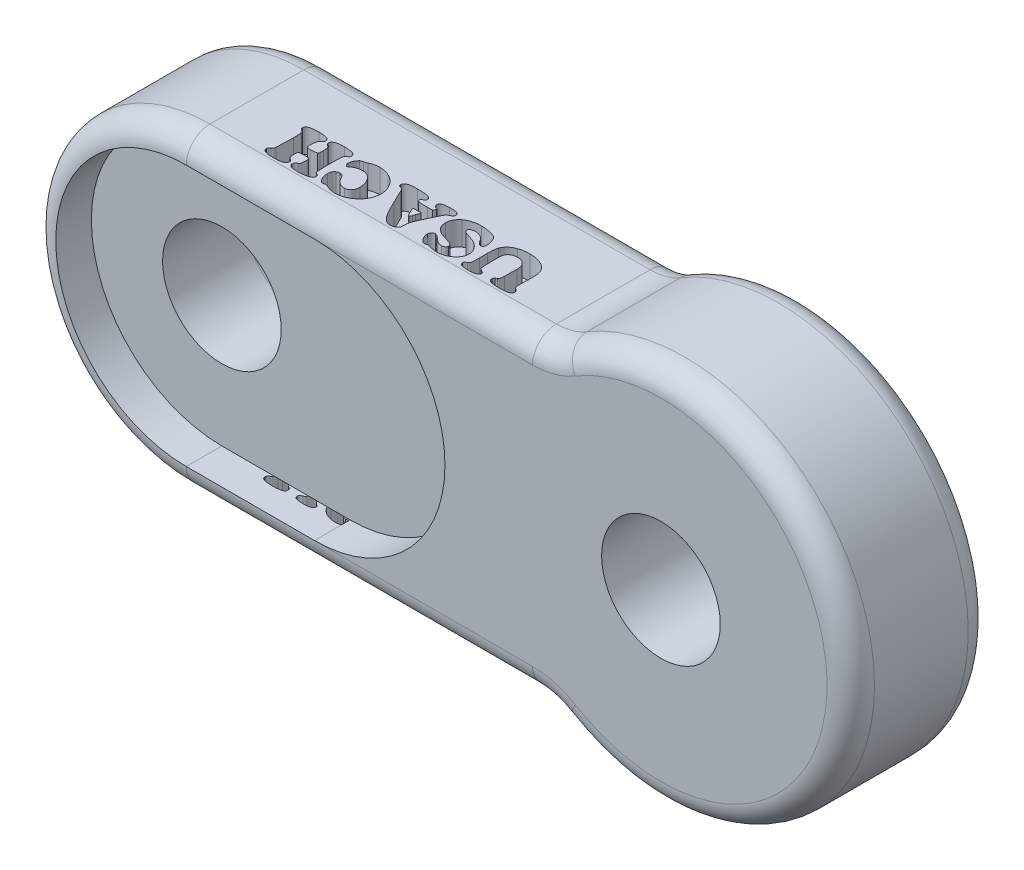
from build123d import *

# Parameters (mm, degrees)
CROQUIS1_R              = 25
SALIENTE_EXTRUIR1_DEPTH = 59.5
CORTAR_EXTRUIR1_DEPTH   = 10
CORTAR_EXTRUIR2_DEPTH   = 10
REDONDEO1_R             = 10
CORTAR_EXTRUIR3_DEPTH   = 15
CORTAR_EXTRUIR4_DEPTH   = 15


with BuildPart() as part:
    # Croquis1 → Saliente-Extruir1 (new body)
    with BuildSketch(Plane.XY):
        with BuildLine():
            Line((0, 65), (145.916730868, 65))
            ThreePointArc((145.916730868, 65), (152.598261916, 65.909397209), (158.793699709, 68.571428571))
            ThreePointArc((158.793699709, 68.571428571), (280, 0), (158.793699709, -68.571428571))
            ThreePointArc((158.793699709, -68.571428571), (152.598261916, -65.909397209), (145.916730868, -65))
            Line((145.916730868, -65), (0, -65))
            ThreePointArc((0, -65), (-65, 0), (0, 65))
        make_face()
        Circle(CROQUIS1_R, mode=Mode.SUBTRACT)
        with Locations((200, 0)):
            Circle(CROQUIS1_R, mode=Mode.SUBTRACT)
    extrude(amount=SALIENTE_EXTRUIR1_DEPTH)

    # Croquis2 → Cortar-Extruir1 (cut)
    # profile 1 of 5: a face of its own
    with BuildSketch(Plane.XZ.offset(65)):
        with BuildLine():
            Line((40.287686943, 41.473008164), (40.287686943, 38.193929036))
            add(Edge.make_bspline(
                [(40.287686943, 38.193929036), (40.28585396, 37.956362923), (40.28232119, 37.49849385), (40.263766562, 36.837573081), (40.227440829, 36.230177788), (40.180141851, 35.677375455), (40.12181135, 35.178758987), (40.047019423, 34.734812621), (39.95681077, 34.343909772), (39.879501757, 34.10564968), (39.843269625, 33.993985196)],
                knots=[0, 0, 0, 0, 1.344732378, 2.591747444, 3.741996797, 4.78841022, 5.73195967, 6.582671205, 7.335745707, 8, 8, 8, 8], degree=3))
            add(Edge.make_bspline(
                [(39.843269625, 33.993985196), (39.756573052, 33.781855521), (39.583957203, 33.359498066), (39.228674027, 32.771990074), (38.807025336, 32.228786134), (38.311360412, 31.731153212), (37.745426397, 31.279565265), (37.107088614, 30.872311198), (36.395053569, 30.517086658), (35.887933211, 30.319820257), (35.627310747, 30.218439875)],
                knots=[0, 0, 0, 0, 0.93871332, 1.869010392, 2.805166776, 3.753454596, 4.742524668, 5.768981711, 6.853421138, 8, 8, 8, 8], degree=3))
            add(Edge.make_bspline(
                [(35.627310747, 30.218439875), (35.29020547, 30.106247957), (34.603386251, 29.877667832), (33.514416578, 29.656259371), (32.363948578, 29.51650098), (31.574605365, 29.501451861), (31.171126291, 29.493759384)],
                knots=[0, 0, 0, 0, 0.938973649, 1.913067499, 2.933247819, 4, 4, 4, 4], degree=3))
            add(Edge.make_bspline(
                [(31.171126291, 29.493759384), (30.818562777, 29.499567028), (30.130751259, 29.510897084), (29.126000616, 29.609038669), (28.174161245, 29.76725322), (27.27545238, 29.990934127), (26.429354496, 30.277111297), (25.642724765, 30.637956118), (24.9021428, 31.050632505), (24.452258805, 31.382637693), (24.228607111, 31.547688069)],
                knots=[0, 0, 0, 0, 1.146887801, 2.237448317, 3.281122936, 4.283728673, 5.247714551, 6.182434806, 7.096430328, 8, 8, 8, 8], degree=3))
            add(Edge.make_bspline(
                [(24.228607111, 31.547688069), (24.028918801, 31.717469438), (23.639418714, 32.048634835), (23.147874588, 32.620360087), (22.749716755, 33.228550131), (22.499095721, 33.776404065), (22.353750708, 34.246280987), (22.251644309, 34.633058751), (22.169035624, 35.058478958), (22.102265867, 35.520869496), (22.049885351, 36.020386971), (22.016279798, 36.55605084), (21.9903939, 37.128681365), (21.987824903, 37.522599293), (21.986501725, 37.725489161)],
                knots=[0, 0, 0, 0, 1.376233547, 2.684398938, 3.947382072, 5.187652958, 5.835563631, 6.531566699, 7.289720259, 8.112273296, 8.987029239, 9.929295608, 10.93347088, 12, 12, 12, 12], degree=3))
            add(Edge.make_bspline(
                [(21.986501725, 37.725489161), (21.986194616, 37.813574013), (21.985533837, 38.003098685), (21.991321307, 38.307360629), (21.993803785, 38.651722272), (22.00222981, 39.034762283), (22.015352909, 39.457759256), (22.027112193, 39.919535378), (22.038091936, 40.421401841), (22.048935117, 40.768354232), (22.054565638, 40.948515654)],
                knots=[0, 0, 0, 0, 0.65572948, 1.410877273, 2.265370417, 3.219365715, 4.262997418, 5.415877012, 6.658146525, 8, 8, 8, 8], degree=3))
            add(Edge.make_bspline(
                [(22.054565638, 40.948515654), (22.057167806, 41.075302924), (22.062125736, 41.316871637), (22.070264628, 41.662526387), (22.077954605, 41.9748318), (22.086708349, 42.253700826), (22.092003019, 42.49928368), (22.088640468, 42.710206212), (22.095687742, 42.88764261), (22.094939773, 42.994433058), (22.094603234, 43.042481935)],
                knots=[0, 0, 0, 0, 1.45314883, 2.768695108, 3.961934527, 5.032875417, 5.965868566, 6.776393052, 7.449455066, 8, 8, 8, 8], degree=3))
            add(Edge.make_bspline(
                [(22.094603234, 43.042481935), (22.09160475, 43.214621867), (22.086114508, 43.529811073), (22.064759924, 43.961538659), (22.008437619, 44.305359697), (21.938857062, 44.582428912), (21.821511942, 44.810909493), (21.656763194, 45.015155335), (21.444826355, 45.214126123), (21.278190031, 45.330779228), (21.18975356, 45.392688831)],
                knots=[0, 0, 0, 0, 1.548976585, 2.836185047, 3.88214687, 4.680231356, 5.394261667, 6.172323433, 7.030023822, 8, 8, 8, 8], degree=3))
            add(Edge.make_bspline(
                [(21.18975356, 45.392688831), (21.055542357, 45.48606537), (20.805945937, 45.659720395), (20.524390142, 45.982417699), (20.334017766, 46.321592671), (20.311786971, 46.563592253), (20.300918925, 46.681899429)],
                knots=[0, 0, 0, 0, 1.198633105, 2.229132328, 3.134269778, 4, 4, 4, 4], degree=3))
            add(Edge.make_bspline(
                [(20.300918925, 46.681899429), (20.306225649, 46.76804156), (20.316667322, 46.937537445), (20.403385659, 47.181198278), (20.537085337, 47.410097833), (20.729510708, 47.615635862), (20.958164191, 47.80347382), (21.229232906, 47.955212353), (21.529190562, 48.082254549), (21.746606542, 48.133130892), (21.858381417, 48.159286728)],
                knots=[0, 0, 0, 0, 0.88863173, 1.748498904, 2.645665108, 3.613124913, 4.643520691, 5.694692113, 6.814827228, 8, 8, 8, 8], degree=3))
            add(Edge.make_bspline(
                [(21.858381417, 48.159286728), (22.102197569, 48.204522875), (22.609076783, 48.298566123), (23.408309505, 48.394129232), (24.272034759, 48.442407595), (24.869154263, 48.451084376), (25.177498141, 48.45556494)],
                knots=[0, 0, 0, 0, 0.891374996, 1.853115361, 2.891379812, 4, 4, 4, 4], degree=3))
            add(Edge.make_bspline(
                [(25.177498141, 48.45556494), (25.513943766, 48.452484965), (26.156812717, 48.446599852), (27.076295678, 48.381751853), (27.90771149, 48.279513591), (28.426499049, 48.168124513), (28.672780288, 48.115245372)],
                knots=[0, 0, 0, 0, 1.146950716, 2.191554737, 3.141486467, 4, 4, 4, 4], degree=3))
            add(Edge.make_bspline(
                [(28.672780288, 48.115245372), (28.780460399, 48.087448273), (28.985470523, 48.034525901), (29.26627553, 47.912979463), (29.502697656, 47.764681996), (29.704025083, 47.595462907), (29.850877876, 47.390877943), (29.963661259, 47.166277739), (30.028601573, 46.912342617), (30.034828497, 46.734316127), (30.038062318, 46.641861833)],
                knots=[0, 0, 0, 0, 1.213892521, 2.311107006, 3.326690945, 4.256803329, 5.163880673, 6.057375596, 6.991139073, 8, 8, 8, 8], degree=3))
            add(Edge.make_bspline(
                [(30.038062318, 46.641861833), (30.033041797, 46.552107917), (30.023386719, 46.379500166), (29.96060378, 46.131761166), (29.841644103, 45.915286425), (29.732331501, 45.796401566), (29.677723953, 45.737012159)],
                knots=[0, 0, 0, 0, 1.07591295, 2.069112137, 3.035417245, 4, 4, 4, 4], degree=3))
            add(Edge.make_bspline(
                [(29.677723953, 45.737012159), (29.652515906, 45.718120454), (29.582575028, 45.665704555), (29.44191248, 45.574419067), (29.231706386, 45.456151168), (29.069256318, 45.367134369), (28.977066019, 45.316617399)],
                knots=[0, 0, 0, 0, 0.462112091, 1.282151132, 2.457622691, 4, 4, 4, 4], degree=3))
            add(Edge.make_bspline(
                [(28.977066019, 45.316617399), (28.917542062, 45.280651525), (28.798726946, 45.208860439), (28.65538619, 45.048255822), (28.543009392, 44.851713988), (28.45621738, 44.609563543), (28.406920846, 44.307625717), (28.36045657, 43.935301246), (28.341004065, 43.481732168), (28.338052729, 43.151910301), (28.33646448, 42.974418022)],
                knots=[0, 0, 0, 0, 0.653481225, 1.30440669, 2.004563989, 2.781766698, 3.718299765, 4.885719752, 6.324062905, 8, 8, 8, 8], degree=3))
            add(Edge.make_bspline(
                [(28.33646448, 42.974418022), (28.336682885, 42.86231193), (28.337176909, 42.608732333), (28.332407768, 42.185659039), (28.324596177, 41.677173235), (28.311148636, 41.084667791), (28.300595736, 40.406645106), (28.284225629, 39.64326361), (28.263099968, 38.793187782), (28.250820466, 38.197938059), (28.244378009, 37.885639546)],
                knots=[0, 0, 0, 0, 0.528621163, 1.19572041, 1.995044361, 2.926615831, 3.99031882, 5.192566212, 6.527076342, 8, 8, 8, 8], degree=3))
            add(Edge.make_bspline(
                [(28.244378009, 37.885639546), (28.241946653, 37.697320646), (28.237211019, 37.330525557), (28.292706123, 36.798964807), (28.381251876, 36.300268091), (28.523128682, 35.837527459), (28.706569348, 35.406854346), (28.936099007, 35.010296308), (29.213081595, 34.651280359), (29.429480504, 34.44257615), (29.537592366, 34.338308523)],
                knots=[0, 0, 0, 0, 1.157113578, 2.253749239, 3.280616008, 4.267076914, 5.222852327, 6.153206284, 7.07735067, 8, 8, 8, 8], degree=3))
            add(Edge.make_bspline(
                [(29.537592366, 34.338308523), (29.631832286, 34.257117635), (29.819019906, 34.095849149), (30.132813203, 33.897346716), (30.460912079, 33.722652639), (30.812252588, 33.584160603), (31.179520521, 33.469648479), (31.569243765, 33.396266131), (31.977220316, 33.34573404), (32.25731493, 33.340195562), (32.400280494, 33.337368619)],
                knots=[0, 0, 0, 0, 0.960801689, 1.908428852, 2.864116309, 3.832043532, 4.824641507, 5.83474115, 6.894811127, 8, 8, 8, 8], degree=3))
            add(Edge.make_bspline(
                [(32.400280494, 33.337368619), (32.582070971, 33.341406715), (32.937985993, 33.349312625), (33.457142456, 33.428156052), (33.949336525, 33.552611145), (34.413347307, 33.721481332), (34.834488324, 33.942282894), (35.212688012, 34.193089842), (35.534986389, 34.487670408), (35.706590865, 34.714553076), (35.791464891, 34.826767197)],
                knots=[0, 0, 0, 0, 1.133621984, 2.219440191, 3.267662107, 4.297867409, 5.292315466, 6.227726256, 7.123449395, 8, 8, 8, 8], degree=3))
            add(Edge.make_bspline(
                [(35.791464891, 34.826767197), (35.850759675, 34.916378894), (35.969381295, 35.095650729), (36.112708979, 35.384588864), (36.225524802, 35.688126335), (36.311543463, 36.012557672), (36.370564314, 36.376011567), (36.41247457, 36.79046834), (36.441412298, 37.264657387), (36.443154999, 37.599989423), (36.444077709, 37.777538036)],
                knots=[0, 0, 0, 0, 0.838263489, 1.676980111, 2.511089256, 3.362778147, 4.292878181, 5.382502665, 6.614110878, 8, 8, 8, 8], degree=3))
            Line((36.444077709, 37.777538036), (36.444077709, 40.756335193))
            add(Edge.make_bspline(
                [(36.444077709, 40.756335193), (36.439174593, 41.027265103), (36.429923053, 41.538474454), (36.410249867, 42.261866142), (36.385816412, 42.895750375), (36.361840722, 43.441614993), (36.339211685, 43.898213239), (36.313073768, 44.2669173), (36.280734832, 44.547184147), (36.244200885, 44.803391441), (36.152572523, 45.057322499), (35.960739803, 45.308473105), (35.697635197, 45.530009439), (35.482072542, 45.636275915), (35.367066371, 45.692970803)],
                knots=[0, 0, 0, 0, 1.826607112, 3.446569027, 4.878001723, 6.10269112, 7.129690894, 7.959744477, 8.593586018, 9.03136576, 9.703144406, 10.385086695, 11.138417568, 12, 12, 12, 12], degree=3))
            add(Edge.make_bspline(
                [(35.367066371, 45.692970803), (35.258293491, 45.742295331), (35.055404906, 45.834297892), (34.785614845, 45.980993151), (34.568295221, 46.117370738), (34.400541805, 46.249059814), (34.282557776, 46.394209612), (34.195300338, 46.547206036), (34.146993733, 46.719109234), (34.140973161, 46.837771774), (34.137912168, 46.898102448)],
                knots=[0, 0, 0, 0, 1.562707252, 2.914839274, 4.014651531, 4.9203682, 5.689671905, 6.447992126, 7.210924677, 8, 8, 8, 8], degree=3))
            add(Edge.make_bspline(
                [(34.137912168, 46.898102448), (34.141135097, 46.963768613), (34.147458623, 47.092608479), (34.192781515, 47.277862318), (34.264850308, 47.452160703), (34.3756245, 47.606143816), (34.510389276, 47.75041384), (34.675753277, 47.877721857), (34.871581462, 47.990352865), (35.09737947, 48.089726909), (35.357074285, 48.178521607), (35.652050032, 48.252203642), (35.982151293, 48.316335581), (36.34704331, 48.367366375), (36.749073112, 48.407463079), (37.187227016, 48.43278834), (37.660986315, 48.455888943), (37.988160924, 48.455675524), (38.157686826, 48.45556494)],
                knots=[0, 0, 0, 0, 0.665502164, 1.305744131, 1.924296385, 2.566395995, 3.217563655, 3.921599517, 4.673828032, 5.503989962, 6.420092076, 7.454295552, 8.585233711, 9.829574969, 11.18999129, 12.682034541, 14.280792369, 16, 16, 16, 16], degree=3))
            add(Edge.make_bspline(
                [(38.157686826, 48.45556494), (38.324542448, 48.455662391), (38.646378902, 48.455850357), (39.1108236, 48.433030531), (39.539573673, 48.407113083), (39.932439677, 48.367986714), (40.288592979, 48.314592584), (40.610804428, 48.258518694), (40.894629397, 48.180556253), (41.146075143, 48.098203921), (41.366071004, 48.000616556), (41.557932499, 47.892194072), (41.716543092, 47.763459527), (41.853255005, 47.629284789), (41.95173481, 47.472510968), (42.032534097, 47.309180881), (42.07049582, 47.126611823), (42.07766809, 47.002316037), (42.081371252, 46.938140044)],
                knots=[0, 0, 0, 0, 1.734701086, 3.345946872, 4.833977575, 6.201001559, 7.449175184, 8.57869455, 9.598642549, 10.507040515, 11.327085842, 12.098236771, 12.7895926, 13.447112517, 14.078332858, 14.70542103, 15.331587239, 16, 16, 16, 16], degree=3))
            add(Edge.make_bspline(
                [(42.081371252, 46.938140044), (42.080339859, 46.877978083), (42.078401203, 46.764894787), (42.051099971, 46.606495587), (42.002992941, 46.472684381), (41.933367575, 46.351207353), (41.816772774, 46.237599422), (41.646559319, 46.110797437), (41.422527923, 45.951827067), (41.247969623, 45.844019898), (41.152499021, 45.785057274)],
                knots=[0, 0, 0, 0, 0.913787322, 1.717598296, 2.429935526, 3.06661701, 3.827017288, 4.882102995, 6.294738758, 8, 8, 8, 8], degree=3))
            add(Edge.make_bspline(
                [(41.152499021, 45.785057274), (41.052437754, 45.720436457), (40.865768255, 45.599882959), (40.642586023, 45.380403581), (40.482363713, 45.157310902), (40.400740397, 44.945825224), (40.381427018, 44.734823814), (40.360481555, 44.501504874), (40.341013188, 44.189068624), (40.325732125, 43.79797011), (40.31529522, 43.328090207), (40.3017809, 42.779626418), (40.295633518, 42.15231044), (40.290434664, 41.707893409), (40.287686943, 41.473008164)],
                knots=[0, 0, 0, 0, 0.92552439, 1.726613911, 2.421408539, 3.052750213, 3.461404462, 4.066448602, 4.878785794, 5.898172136, 7.114581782, 8.538798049, 10.170670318, 12, 12, 12, 12], degree=3))
        make_face()
    # profile 2 of 5: a face of its own
    with BuildSketch(Plane.XZ.offset(65)):
        with BuildLine():
            add(Edge.make_bspline(
                [(51.638345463, 48.45556494), (51.759853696, 48.45278314), (52.013911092, 48.446966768), (52.407922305, 48.412984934), (52.830321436, 48.361804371), (53.278422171, 48.28315331), (53.754473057, 48.188996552), (54.256713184, 48.065403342), (54.787216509, 47.9273394), (55.148579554, 47.821283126), (55.333815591, 47.766918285)],
                knots=[0, 0, 0, 0, 0.773334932, 1.61693947, 2.515573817, 3.480445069, 4.511531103, 5.603376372, 6.771481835, 8, 8, 8, 8], degree=3))
            add(Edge.make_bspline(
                [(55.333815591, 47.766918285), (55.416010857, 47.743711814), (55.560391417, 47.702948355), (55.709854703, 47.691691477), (55.774229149, 47.686843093)],
                knots=[0, 0, 0, 0, 1.138591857, 2, 2, 2, 2], degree=3))
            add(Edge.make_bspline(
                [(55.774229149, 47.686843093), (55.809057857, 47.691530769), (55.901369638, 47.703955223), (56.071817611, 47.753685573), (56.310215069, 47.829646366), (56.492352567, 47.891953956), (56.594999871, 47.92706867)],
                knots=[0, 0, 0, 0, 0.491859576, 1.303649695, 2.48041676, 4, 4, 4, 4], degree=3))
            add(Edge.make_bspline(
                [(56.594999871, 47.92706867), (56.670406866, 47.952092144), (56.821231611, 48.002142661), (56.980030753, 48.008145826), (57.059435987, 48.011147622)],
                knots=[0, 0, 0, 0, 0.999928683, 2, 2, 2, 2], degree=3))
            add(Edge.make_bspline(
                [(57.059435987, 48.011147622), (57.137209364, 48.00573676), (57.29523288, 47.994742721), (57.533305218, 47.92780093), (57.770606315, 47.810401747), (58.016182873, 47.656459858), (58.254340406, 47.444816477), (58.50559721, 47.201238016), (58.755735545, 46.907914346), (59.001589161, 46.57704861), (59.237067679, 46.229376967), (59.447521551, 45.877947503), (59.617671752, 45.52769154), (59.765833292, 45.186036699), (59.877668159, 44.845494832), (59.957730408, 44.509376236), (60.008972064, 44.177117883), (60.01514326, 43.956852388), (60.018214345, 43.847237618)],
                knots=[0, 0, 0, 0, 0.684457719, 1.390712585, 2.157308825, 3.007185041, 3.93153842, 4.952505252, 6.084389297, 7.316916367, 8.576863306, 9.776704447, 10.915869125, 11.999427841, 13.049928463, 14.063513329, 15.036310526, 16, 16, 16, 16], degree=3))
            add(Edge.make_bspline(
                [(60.018214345, 43.847237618), (60.013671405, 43.725154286), (60.004854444, 43.488214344), (59.911873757, 43.14938491), (59.766962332, 42.838255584), (59.56277312, 42.566335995), (59.322927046, 42.336110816), (59.046721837, 42.173611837), (58.74755952, 42.065179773), (58.536446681, 42.054830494), (58.428721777, 42.04954955)],
                knots=[0, 0, 0, 0, 1.096137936, 2.127389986, 3.137372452, 4.167854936, 5.17052742, 6.107691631, 7.034408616, 8, 8, 8, 8], degree=3))
            add(Edge.make_bspline(
                [(58.428721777, 42.04954955), (58.340375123, 42.050757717), (58.171773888, 42.053063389), (57.932901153, 42.100415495), (57.717329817, 42.166220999), (57.551604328, 42.251052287), (57.417240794, 42.343716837), (57.293071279, 42.441710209), (57.142722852, 42.565057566), (56.964067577, 42.713081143), (56.766598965, 42.895218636), (56.53798867, 43.09894646), (56.279671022, 43.326081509), (56.103375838, 43.491692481), (56.010450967, 43.578985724)],
                knots=[0, 0, 0, 0, 1.077980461, 2.057223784, 2.965377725, 3.82643366, 4.319711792, 4.959381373, 5.759540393, 6.697543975, 7.795103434, 9.043052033, 10.441398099, 12, 12, 12, 12], degree=3))
            add(Edge.make_bspline(
                [(56.010450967, 43.578985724), (55.874445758, 43.700775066), (55.609369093, 43.938144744), (55.198428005, 44.25656474), (54.783839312, 44.518344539), (54.378720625, 44.745823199), (53.968934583, 44.912513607), (53.56168364, 45.034736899), (53.155889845, 45.110045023), (52.885150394, 45.11967782), (52.751390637, 45.124436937)],
                knots=[0, 0, 0, 0, 1.18634838, 2.312214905, 3.373239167, 4.370712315, 5.327458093, 6.241293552, 7.131105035, 8, 8, 8, 8], degree=3))
            add(Edge.make_bspline(
                [(52.751390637, 45.124436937), (52.628405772, 45.119411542), (52.393973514, 45.109832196), (52.057960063, 45.04893482), (51.764400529, 44.929931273), (51.507489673, 44.776759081), (51.306408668, 44.578159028), (51.155693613, 44.351756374), (51.063581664, 44.092869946), (51.054469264, 43.909376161), (51.049792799, 43.815207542)],
                knots=[0, 0, 0, 0, 1.22680445, 2.338519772, 3.383741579, 4.369685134, 5.301239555, 6.175937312, 7.06389491, 8, 8, 8, 8], degree=3))
            add(Edge.make_bspline(
                [(51.049792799, 43.815207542), (51.055534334, 43.720834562), (51.067027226, 43.531927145), (51.174748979, 43.261977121), (51.343159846, 43.012801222), (51.580593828, 42.78625373), (51.878514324, 42.574935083), (52.242956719, 42.384344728), (52.671383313, 42.212219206), (52.982725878, 42.118988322), (53.147762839, 42.069568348)],
                knots=[0, 0, 0, 0, 0.771184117, 1.543687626, 2.348175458, 3.222801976, 4.219098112, 5.33555604, 6.587627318, 8, 8, 8, 8], degree=3))
            add(Edge.make_bspline(
                [(53.147762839, 42.069568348), (53.373477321, 42.004747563), (53.804132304, 41.881071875), (54.415959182, 41.695665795), (54.966507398, 41.528386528), (55.452137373, 41.372924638), (55.875532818, 41.232344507), (56.234310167, 41.106872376), (56.528631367, 40.989940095), (56.701933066, 40.914206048), (56.779172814, 40.880451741)],
                knots=[0, 0, 0, 0, 1.473999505, 2.812337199, 4.012690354, 5.085619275, 6.012771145, 6.812928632, 7.470927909, 8, 8, 8, 8], degree=3))
            add(Edge.make_bspline(
                [(56.779172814, 40.880451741), (56.921623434, 40.811588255), (57.201386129, 40.676345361), (57.595778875, 40.445803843), (57.966187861, 40.210524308), (58.308791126, 39.962351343), (58.621114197, 39.696410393), (58.908737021, 39.421195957), (59.172599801, 39.136033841), (59.404170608, 38.834982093), (59.609841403, 38.522179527), (59.785399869, 38.1956267), (59.939318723, 37.861295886), (60.05959542, 37.510673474), (60.1557, 37.149514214), (60.222026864, 36.774384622), (60.270014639, 36.389471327), (60.272962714, 36.128143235), (60.274454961, 35.995865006)],
                knots=[0, 0, 0, 0, 1.190175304, 2.337418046, 3.435015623, 4.491600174, 5.517725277, 6.519228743, 7.485938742, 8.438089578, 9.374001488, 10.299728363, 11.225618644, 12.140330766, 13.085464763, 14.034910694, 15.005317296, 16, 16, 16, 16], degree=3))
            add(Edge.make_bspline(
                [(60.274454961, 35.995865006), (60.268155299, 35.763164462), (60.255768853, 35.305626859), (60.13958961, 34.637857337), (59.955172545, 34.001619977), (59.694386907, 33.398015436), (59.353576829, 32.829681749), (58.941389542, 32.295014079), (58.458965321, 31.788600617), (58.089390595, 31.491541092), (57.900225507, 31.339492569)],
                knots=[0, 0, 0, 0, 1.027652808, 2.020578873, 2.985519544, 3.9497389, 4.917775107, 5.90636473, 6.928382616, 8, 8, 8, 8], degree=3))
            add(Edge.make_bspline(
                [(57.900225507, 31.339492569), (57.692023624, 31.191243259), (57.273445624, 30.893196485), (56.59223747, 30.518250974), (55.865832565, 30.199920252), (55.092655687, 29.940416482), (54.272472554, 29.741488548), (53.408022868, 29.598593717), (52.497092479, 29.507773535), (51.873453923, 29.498503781), (51.554266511, 29.493759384)],
                knots=[0, 0, 0, 0, 0.911251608, 1.832019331, 2.767976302, 3.737636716, 4.737705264, 5.77565062, 6.861545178, 8, 8, 8, 8], degree=3))
            add(Edge.make_bspline(
                [(51.554266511, 29.493759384), (51.259174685, 29.498320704), (50.658701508, 29.507602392), (49.747112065, 29.586925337), (48.812314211, 29.716845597), (48.026911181, 29.860700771), (47.40894058, 29.997527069), (46.975248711, 30.106319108), (46.573551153, 30.216231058), (46.207718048, 30.337997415), (45.871704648, 30.455474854), (45.574130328, 30.585081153), (45.305074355, 30.710420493), (45.144817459, 30.808251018), (45.068175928, 30.855037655)],
                knots=[0, 0, 0, 0, 1.588377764, 3.232140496, 4.921862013, 6.667833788, 7.528935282, 8.328750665, 9.074841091, 9.770077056, 10.40415461, 10.989995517, 11.516973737, 12, 12, 12, 12], degree=3))
            add(Edge.make_bspline(
                [(45.068175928, 30.855037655), (45.014024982, 30.89543822), (44.90083713, 30.979884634), (44.738783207, 31.132593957), (44.589456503, 31.323312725), (44.440670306, 31.54185581), (44.291399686, 31.788785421), (44.155125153, 32.071531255), (44.01092341, 32.379879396), (43.841260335, 32.83482607), (43.650560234, 33.418575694), (43.487554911, 34.124540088), (43.380424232, 34.820814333), (43.368482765, 35.282818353), (43.36257433, 35.511410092)],
                knots=[0, 0, 0, 0, 0.47725386, 0.997569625, 1.567562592, 2.184896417, 2.865804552, 3.603874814, 4.401537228, 5.270238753, 7.032874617, 8.737122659, 10.385583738, 12, 12, 12, 12], degree=3))
            add(Edge.make_bspline(
                [(43.36257433, 35.511410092), (43.364725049, 35.61449775), (43.36875213, 35.807522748), (43.42219999, 36.077378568), (43.505406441, 36.310120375), (43.595966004, 36.436507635), (43.638833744, 36.496334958)],
                knots=[0, 0, 0, 0, 1.184443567, 2.217794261, 3.156365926, 4, 4, 4, 4], degree=3))
            add(Edge.make_bspline(
                [(43.638833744, 36.496334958), (43.697406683, 36.562208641), (43.810082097, 36.688928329), (44.022781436, 36.824518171), (44.257204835, 36.90913714), (44.422838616, 36.919454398), (44.507649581, 36.924737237)],
                knots=[0, 0, 0, 0, 1.050954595, 2.021697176, 2.987031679, 4, 4, 4, 4], degree=3))
            add(Edge.make_bspline(
                [(44.507649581, 36.924737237), (44.595220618, 36.918299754), (44.774189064, 36.905143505), (45.036511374, 36.802064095), (45.287300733, 36.632513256), (45.437464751, 36.485646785), (45.516597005, 36.408252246)],
                knots=[0, 0, 0, 0, 0.900274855, 1.839886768, 2.86168051, 4, 4, 4, 4], degree=3))
            add(Edge.make_bspline(
                [(45.516597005, 36.408252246), (45.544794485, 36.377713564), (45.61217457, 36.304738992), (45.72356102, 36.173973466), (45.854227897, 35.998507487), (46.016523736, 35.787557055), (46.197102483, 35.531321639), (46.408334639, 35.238527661), (46.637539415, 34.902755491), (46.800370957, 34.666546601), (46.885882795, 34.542500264)],
                knots=[0, 0, 0, 0, 0.430740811, 1.029288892, 1.778934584, 2.69726761, 3.787316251, 5.026880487, 6.438650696, 8, 8, 8, 8], degree=3))
            add(Edge.make_bspline(
                [(46.885882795, 34.542500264), (46.979167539, 34.419881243), (47.171255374, 34.167389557), (47.552327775, 33.850333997), (47.99603674, 33.554048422), (48.509272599, 33.302759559), (49.062476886, 33.091745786), (49.63566324, 32.94074678), (50.21773867, 32.843764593), (50.609002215, 32.831199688), (50.805563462, 32.824887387)],
                knots=[0, 0, 0, 0, 0.8332964, 1.715887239, 2.671600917, 3.723780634, 4.807464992, 5.87859998, 6.934260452, 8, 8, 8, 8], degree=3))
            add(Edge.make_bspline(
                [(50.805563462, 32.824887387), (50.968569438, 32.829878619), (51.279915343, 32.83941201), (51.723069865, 32.90036864), (52.116974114, 33.012467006), (52.456951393, 33.167584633), (52.741336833, 33.352982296), (52.94322722, 33.579365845), (53.0781554, 33.829882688), (53.09250686, 34.011056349), (53.099717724, 34.102086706)],
                knots=[0, 0, 0, 0, 1.355034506, 2.588153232, 3.708150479, 4.745608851, 5.687179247, 6.504336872, 7.248506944, 8, 8, 8, 8], degree=3))
            add(Edge.make_bspline(
                [(53.099717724, 34.102086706), (53.093323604, 34.187001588), (53.080553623, 34.356588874), (52.982919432, 34.599986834), (52.820937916, 34.82115522), (52.590195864, 35.018671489), (52.295847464, 35.209026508), (51.923328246, 35.386024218), (51.47433806, 35.556851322), (51.145298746, 35.655143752), (50.969717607, 35.707594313)],
                knots=[0, 0, 0, 0, 0.712810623, 1.423585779, 2.171246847, 2.998045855, 3.963141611, 5.112689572, 6.459280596, 8, 8, 8, 8], degree=3))
            add(Edge.make_bspline(
                [(50.969717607, 35.707594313), (50.65950376, 35.799101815), (50.075231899, 35.971451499), (49.262751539, 36.242346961), (48.568241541, 36.503965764), (47.976373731, 36.765742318), (47.455053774, 37.044347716), (46.96443362, 37.344678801), (46.492555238, 37.681324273), (46.191930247, 37.926683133), (46.041089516, 38.04979369)],
                knots=[0, 0, 0, 0, 1.4100512, 2.655759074, 3.733164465, 4.644773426, 5.475138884, 6.308434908, 7.151245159, 8, 8, 8, 8], degree=3))
            add(Edge.make_bspline(
                [(46.041089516, 38.04979369), (45.868331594, 38.205313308), (45.531036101, 38.508952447), (45.09213176, 39.008407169), (44.714681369, 39.518182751), (44.408227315, 40.04569353), (44.16788685, 40.590451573), (44.002545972, 41.153288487), (43.890803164, 41.730176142), (43.88032712, 42.121092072), (43.875055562, 42.317801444)],
                knots=[0, 0, 0, 0, 1.127646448, 2.201636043, 3.221533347, 4.202810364, 5.157392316, 6.104424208, 7.046143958, 8, 8, 8, 8], degree=3))
            add(Edge.make_bspline(
                [(43.875055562, 42.317801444), (43.882234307, 42.514437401), (43.896545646, 42.906445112), (44.005129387, 43.490083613), (44.1827713, 44.064325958), (44.427639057, 44.627837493), (44.733167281, 45.170941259), (45.104706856, 45.678144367), (45.53513811, 46.14654263), (45.860502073, 46.422303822), (46.025074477, 46.56178664)],
                knots=[0, 0, 0, 0, 0.959069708, 1.911973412, 2.886287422, 3.886736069, 4.904478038, 5.920447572, 6.948141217, 8, 8, 8, 8], degree=3))
            add(Edge.make_bspline(
                [(46.025074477, 46.56178664), (46.218356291, 46.714005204), (46.603840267, 47.017592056), (47.232108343, 47.398792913), (47.889445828, 47.726229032), (48.577567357, 47.995314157), (49.299715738, 48.198688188), (50.050843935, 48.345590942), (50.833741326, 48.442360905), (51.367131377, 48.451114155), (51.638345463, 48.45556494)],
                knots=[0, 0, 0, 0, 0.975770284, 1.94609002, 2.910288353, 3.888112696, 4.874067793, 5.883869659, 6.924006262, 8, 8, 8, 8], degree=3))
        make_face()
    # profile 3 of 5: a face of its own
    with BuildSketch(Plane.XZ.offset(65)):
        with BuildLine():
            Line((78.727783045, 39.122801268), (81.274174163, 33.781785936))
            add(Edge.make_bspline(
                [(81.274174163, 33.781785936), (81.332153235, 33.667970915), (81.438144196, 33.459906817), (81.593657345, 33.179824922), (81.734426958, 32.96390017), (81.869036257, 32.799888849), (82.019866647, 32.686123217), (82.192597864, 32.595992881), (82.397693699, 32.53077736), (82.545716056, 32.500477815), (82.623441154, 32.48456782)],
                knots=[0, 0, 0, 0, 1.551249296, 2.835823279, 3.887674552, 4.680507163, 5.396934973, 6.165372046, 7.036654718, 8, 8, 8, 8], degree=3))
            add(Edge.make_bspline(
                [(82.623441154, 32.48456782), (82.699933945, 32.469084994), (82.844726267, 32.439777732), (83.045203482, 32.369208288), (83.211594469, 32.26905268), (83.357985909, 32.155750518), (83.460933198, 32.005383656), (83.54025557, 31.838495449), (83.582795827, 31.647147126), (83.589084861, 31.51316963), (83.592350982, 31.443590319)],
                knots=[0, 0, 0, 0, 1.188147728, 2.249031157, 3.214526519, 4.138266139, 5.040746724, 5.959105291, 6.940090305, 8, 8, 8, 8], degree=3))
            add(Edge.make_bspline(
                [(83.592350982, 31.443590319), (83.587852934, 31.360663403), (83.579056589, 31.198492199), (83.528912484, 30.96064973), (83.429099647, 30.745138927), (83.300944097, 30.542907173), (83.12753808, 30.368522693), (82.9254984, 30.202787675), (82.678604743, 30.067841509), (82.398496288, 29.94050416), (82.075968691, 29.834446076), (81.709367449, 29.742446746), (81.295640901, 29.668656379), (80.834808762, 29.605226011), (80.327440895, 29.553230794), (79.773200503, 29.517944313), (79.17233381, 29.499041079), (78.755822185, 29.495564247), (78.539606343, 29.493759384)],
                knots=[0, 0, 0, 0, 0.669154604, 1.308593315, 1.944310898, 2.573900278, 3.228277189, 3.917118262, 4.673697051, 5.487465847, 6.395791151, 7.405543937, 8.532301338, 9.781375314, 11.154766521, 12.64250922, 14.257088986, 16, 16, 16, 16], degree=3))
            add(Edge.make_bspline(
                [(78.539606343, 29.493759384), (78.295378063, 29.494640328), (77.822904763, 29.496344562), (77.138068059, 29.506197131), (76.501632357, 29.533401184), (75.91393596, 29.556996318), (75.376402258, 29.600384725), (74.887246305, 29.640926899), (74.44658432, 29.696725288), (74.170032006, 29.743783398), (74.039380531, 29.766015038)],
                knots=[0, 0, 0, 0, 1.298627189, 2.512267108, 3.641368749, 4.685694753, 5.639232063, 6.5084825, 7.295363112, 8, 8, 8, 8], degree=3))
            add(Edge.make_bspline(
                [(74.039380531, 29.766015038), (73.931612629, 29.789363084), (73.723614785, 29.834426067), (73.438147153, 29.953987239), (73.18344669, 30.09826185), (72.967056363, 30.277814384), (72.792902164, 30.486988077), (72.66665439, 30.719413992), (72.585878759, 30.972563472), (72.578010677, 31.149373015), (72.574004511, 31.239398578)],
                knots=[0, 0, 0, 0, 1.166331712, 2.251082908, 3.265109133, 4.259312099, 5.213681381, 6.131398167, 7.048569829, 8, 8, 8, 8], degree=3))
            add(Edge.make_bspline(
                [(72.574004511, 31.239398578), (72.575333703, 31.307809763), (72.577836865, 31.436643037), (72.62224219, 31.616130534), (72.67739638, 31.775840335), (72.772967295, 31.910403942), (72.899720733, 32.032127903), (73.069439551, 32.141005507), (73.281585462, 32.244751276), (73.438315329, 32.306895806), (73.52289554, 32.340432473)],
                knots=[0, 0, 0, 0, 1.033850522, 1.946967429, 2.792556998, 3.578404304, 4.422782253, 5.44427952, 6.620790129, 8, 8, 8, 8], degree=3))
            add(Edge.make_bspline(
                [(73.52289554, 32.340432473), (73.614778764, 32.378813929), (73.78145604, 32.448438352), (73.98036328, 32.60540713), (74.112421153, 32.79293285), (74.12518898, 32.935134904), (74.131467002, 33.00505657)],
                knots=[0, 0, 0, 0, 1.237427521, 2.244708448, 3.136911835, 4, 4, 4, 4], degree=3))
            add(Edge.make_bspline(
                [(74.131467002, 33.00505657), (74.128974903, 33.069495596), (74.124158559, 33.194033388), (74.070671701, 33.369302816), (73.982799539, 33.522144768), (73.865795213, 33.657925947), (73.7075623, 33.766316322), (73.517526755, 33.852987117), (73.295304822, 33.921227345), (73.134953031, 33.947899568), (73.050451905, 33.961955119)],
                knots=[0, 0, 0, 0, 0.963872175, 1.8628232, 2.714186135, 3.593318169, 4.526154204, 5.564623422, 6.716621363, 8, 8, 8, 8], degree=3))
            add(Edge.make_bspline(
                [(73.050451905, 33.961955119), (72.837077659, 33.985239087), (72.3711568, 34.036081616), (71.609440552, 34.073869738), (70.729852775, 34.103727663), (70.103722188, 34.105271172), (69.771372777, 34.106090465)],
                knots=[0, 0, 0, 0, 0.7841553, 1.712269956, 2.785675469, 4, 4, 4, 4], degree=3))
            add(Edge.make_bspline(
                [(69.771372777, 34.106090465), (69.631243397, 34.104942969), (69.364307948, 34.102757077), (68.986446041, 34.096780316), (68.654174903, 34.079471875), (68.366822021, 34.061702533), (68.123889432, 34.03293443), (67.924113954, 34.003662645), (67.768927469, 33.966093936), (67.685089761, 33.929497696), (67.649380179, 33.913910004)],
                knots=[0, 0, 0, 0, 1.570802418, 2.992255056, 4.235321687, 5.300065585, 6.218574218, 6.976054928, 7.563863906, 8, 8, 8, 8], degree=3))
            add(Edge.make_bspline(
                [(67.649380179, 33.913910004), (67.578883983, 33.861402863), (67.422752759, 33.745112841), (67.265159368, 33.481473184), (67.138481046, 33.190344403), (67.121151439, 32.980934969), (67.11287639, 32.880940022)],
                knots=[0, 0, 0, 0, 0.867762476, 1.921874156, 3.007675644, 4, 4, 4, 4], degree=3))
            add(Edge.make_bspline(
                [(67.11287639, 32.880940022), (67.115841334, 32.825656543), (67.121087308, 32.727841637), (67.208134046, 32.620973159), (67.328895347, 32.577814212), (67.479003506, 32.520989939), (67.687994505, 32.435255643), (67.850634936, 32.377024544), (67.941654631, 32.344436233)],
                knots=[0, 0, 0, 0, 0.919306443, 1.626559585, 2.17364659, 3.069232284, 4.359832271, 6, 6, 6, 6], degree=3))
            add(Edge.make_bspline(
                [(67.941654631, 32.344436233), (68.003781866, 32.320731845), (68.123507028, 32.275051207), (68.285513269, 32.181943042), (68.423287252, 32.072942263), (68.539719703, 31.948143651), (68.621978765, 31.79953658), (68.688712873, 31.63926806), (68.723773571, 31.459746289), (68.728138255, 31.335617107), (68.730395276, 31.271428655)],
                knots=[0, 0, 0, 0, 1.109490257, 2.138094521, 3.105962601, 4.037195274, 4.966290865, 5.926684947, 6.927867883, 8, 8, 8, 8], degree=3))
            add(Edge.make_bspline(
                [(68.730395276, 31.271428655), (68.727171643, 31.199137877), (68.720900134, 31.058497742), (68.67604335, 30.853928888), (68.599419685, 30.664909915), (68.492889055, 30.490104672), (68.358773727, 30.327656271), (68.193301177, 30.178668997), (67.996099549, 30.048794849), (67.771136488, 29.929945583), (67.515243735, 29.82879147), (67.230879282, 29.736007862), (66.916265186, 29.660231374), (66.572165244, 29.602212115), (66.199490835, 29.554542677), (65.797608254, 29.517723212), (65.364743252, 29.499159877), (65.065635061, 29.495601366), (64.9108086, 29.493759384)],
                knots=[0, 0, 0, 0, 0.744158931, 1.447744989, 2.144452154, 2.835032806, 3.547687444, 4.306673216, 5.118561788, 5.973066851, 6.922433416, 7.948112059, 9.051416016, 10.25116308, 11.539864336, 12.919725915, 14.405567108, 16, 16, 16, 16], degree=3))
            add(Edge.make_bspline(
                [(64.9108086, 29.493759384), (64.735956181, 29.494028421), (64.39818135, 29.494548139), (63.909721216, 29.51256335), (63.456840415, 29.533433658), (63.040882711, 29.573034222), (62.659166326, 29.607653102), (62.315235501, 29.666401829), (62.005980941, 29.727814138), (61.814310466, 29.780960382), (61.723815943, 29.806052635)],
                knots=[0, 0, 0, 0, 1.30634612, 2.52356154, 3.651964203, 4.69290921, 5.645465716, 6.514330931, 7.298562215, 8, 8, 8, 8], degree=3))
            add(Edge.make_bspline(
                [(61.723815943, 29.806052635), (61.64933979, 29.833109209), (61.506715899, 29.884923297), (61.315934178, 29.997468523), (61.14760219, 30.121975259), (61.018184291, 30.281463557), (60.912117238, 30.456945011), (60.840597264, 30.658535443), (60.796157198, 30.879779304), (60.790080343, 31.034981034), (60.786936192, 31.11528203)],
                knots=[0, 0, 0, 0, 1.090263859, 2.087885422, 3.045131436, 3.959481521, 4.900128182, 5.860906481, 6.893238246, 8, 8, 8, 8], degree=3))
            add(Edge.make_bspline(
                [(60.786936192, 31.11528203), (60.788533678, 31.184945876), (60.791574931, 31.317570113), (60.833468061, 31.503675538), (60.894893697, 31.667633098), (60.992554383, 31.806443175), (61.125812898, 31.926287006), (61.292620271, 32.042089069), (61.505876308, 32.143364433), (61.660770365, 32.206487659), (61.743834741, 32.240338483)],
                knots=[0, 0, 0, 0, 1.038291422, 1.976672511, 2.835455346, 3.637287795, 4.483485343, 5.50090057, 6.659818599, 8, 8, 8, 8], degree=3))
            add(Edge.make_bspline(
                [(61.743834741, 32.240338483), (61.882663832, 32.297408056), (62.148187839, 32.406559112), (62.510836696, 32.612007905), (62.816854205, 32.84941841), (63.037702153, 33.075543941), (63.199725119, 33.287377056), (63.329178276, 33.486313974), (63.469138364, 33.725713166), (63.624625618, 34.000316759), (63.794176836, 34.314648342), (63.972644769, 34.668636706), (64.160437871, 35.063850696), (64.290299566, 35.339214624), (64.358289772, 35.483383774)],
                knots=[0, 0, 0, 0, 1.254563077, 2.399472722, 3.47335629, 4.483702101, 5.032888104, 5.701553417, 6.467234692, 7.351883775, 8.340668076, 9.453799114, 10.666914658, 12, 12, 12, 12], degree=3))
            Line((64.358289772, 35.483383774), (66.256071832, 39.555207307))
            add(Edge.make_bspline(
                [(66.256071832, 39.555207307), (66.340497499, 39.736551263), (66.502820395, 40.085216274), (66.732211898, 40.592462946), (66.94048878, 41.064892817), (67.128271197, 41.502292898), (67.292158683, 41.90468475), (67.438948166, 42.268896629), (67.557655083, 42.601027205), (67.690880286, 42.992727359), (67.829006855, 43.455782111), (67.938076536, 44.00700518), (68.014882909, 44.551141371), (68.027501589, 44.913321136), (68.033741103, 45.09240686)],
                knots=[0, 0, 0, 0, 1.228608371, 2.362211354, 3.419224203, 4.399763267, 5.285695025, 6.087880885, 6.81131854, 7.451585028, 8.629346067, 9.775563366, 10.900090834, 12, 12, 12, 12], degree=3))
            add(Edge.make_bspline(
                [(68.033741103, 45.09240686), (68.036351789, 45.26726329), (68.041138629, 45.587872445), (68.066851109, 46.025149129), (68.110444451, 46.375271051), (68.163186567, 46.656910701), (68.25493542, 46.893944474), (68.379858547, 47.112918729), (68.543388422, 47.33030687), (68.676469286, 47.461662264), (68.746410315, 47.530696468)],
                knots=[0, 0, 0, 0, 1.594623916, 2.923833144, 3.991009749, 4.812068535, 5.528521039, 6.296840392, 7.104899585, 8, 8, 8, 8], degree=3))
            add(Edge.make_bspline(
                [(68.746410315, 47.530696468), (68.825003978, 47.604519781), (68.98090833, 47.750961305), (69.239731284, 47.938616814), (69.511886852, 48.101289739), (69.803965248, 48.227614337), (70.108011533, 48.334245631), (70.430494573, 48.405797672), (70.768683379, 48.444681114), (70.999096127, 48.451888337), (71.116636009, 48.45556494)],
                knots=[0, 0, 0, 0, 0.989210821, 1.962273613, 2.929065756, 3.894614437, 4.878955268, 5.883830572, 6.920483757, 8, 8, 8, 8], degree=3))
            add(Edge.make_bspline(
                [(71.116636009, 48.45556494), (71.230223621, 48.452458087), (71.455755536, 48.446289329), (71.792937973, 48.397229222), (72.123851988, 48.310453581), (72.454558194, 48.201556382), (72.775302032, 48.047783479), (73.097997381, 47.873709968), (73.414281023, 47.660040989), (73.616132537, 47.497490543), (73.719079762, 47.414587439)],
                knots=[0, 0, 0, 0, 0.952345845, 1.890913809, 2.849094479, 3.81883948, 4.80529607, 5.827115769, 6.891797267, 8, 8, 8, 8], degree=3))
            add(Edge.make_bspline(
                [(73.719079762, 47.414587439), (73.793189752, 47.348620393), (73.951198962, 47.20797268), (74.187183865, 46.967715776), (74.430996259, 46.681090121), (74.685167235, 46.351189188), (74.959474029, 45.984648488), (75.237829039, 45.568797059), (75.533586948, 45.11416315), (75.841922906, 44.618359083), (76.158904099, 44.07787795), (76.489716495, 43.495830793), (76.833492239, 42.870887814), (77.192091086, 42.204717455), (77.556539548, 41.493976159), (77.940394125, 40.74300373), (78.330354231, 39.947670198), (78.593317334, 39.401886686), (78.727783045, 39.122801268)],
                knots=[0, 0, 0, 0, 0.489223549, 1.043068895, 1.659157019, 2.343785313, 3.096755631, 3.91641444, 4.810951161, 5.771638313, 6.795454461, 7.900815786, 9.073253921, 10.312948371, 11.631730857, 13.012235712, 14.472212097, 16, 16, 16, 16], degree=3))
        make_face()
        with BuildLine():
            Line((69.451072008, 37.437218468), (71.721203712, 37.437218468))
            add(Edge.make_bspline(
                [(71.721203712, 37.437218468), (71.81279902, 37.437838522), (71.970710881, 37.438907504), (72.159677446, 37.463208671), (72.298157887, 37.475373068), (72.33365731, 37.527503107), (72.345790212, 37.545319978)],
                knots=[0, 0, 0, 0, 1.669560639, 2.878350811, 3.616645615, 4, 4, 4, 4], degree=3))
            add(Edge.make_bspline(
                [(72.345790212, 37.545319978), (72.343286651, 37.590935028), (72.337456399, 37.697162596), (72.285681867, 37.872387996), (72.218603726, 38.090504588), (72.122518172, 38.348642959), (71.993771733, 38.64646219), (71.850608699, 38.990267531), (71.665432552, 39.369863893), (71.536862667, 39.637881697), (71.468966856, 39.779417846)],
                knots=[0, 0, 0, 0, 0.453589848, 1.056312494, 1.808652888, 2.729454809, 3.795663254, 5.039823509, 6.436775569, 8, 8, 8, 8], degree=3))
            add(Edge.make_bspline(
                [(71.468966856, 39.779417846), (71.412140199, 39.901122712), (71.30784276, 40.124495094), (71.158157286, 40.425017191), (71.025091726, 40.657616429), (70.916094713, 40.834681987), (70.813402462, 40.96155494), (70.711006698, 41.049129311), (70.604481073, 41.107770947), (70.528731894, 41.113768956), (70.492049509, 41.116673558)],
                knots=[0, 0, 0, 0, 1.874915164, 3.441146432, 4.684238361, 5.614356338, 6.341820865, 6.950033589, 7.491542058, 8, 8, 8, 8], degree=3))
            add(Edge.make_bspline(
                [(70.492049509, 41.116673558), (70.427725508, 41.103605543), (70.282990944, 41.074201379), (70.108234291, 40.874115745), (69.962716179, 40.582091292), (69.886548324, 40.345643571), (69.84344045, 40.211823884)],
                knots=[0, 0, 0, 0, 0.654804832, 1.473367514, 2.570029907, 4, 4, 4, 4], degree=3))
            add(Edge.make_bspline(
                [(69.84344045, 40.211823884), (69.831337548, 40.177155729), (69.796977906, 40.078734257), (69.734380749, 39.885606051), (69.636536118, 39.60816922), (69.5666026, 39.392582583), (69.527143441, 39.270940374)],
                knots=[0, 0, 0, 0, 0.443897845, 1.260207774, 2.454104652, 4, 4, 4, 4], degree=3))
            add(Edge.make_bspline(
                [(69.527143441, 39.270940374), (69.478263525, 39.164533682), (69.386437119, 38.964636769), (69.268934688, 38.676202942), (69.157744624, 38.428184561), (69.074850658, 38.20781036), (69.00415318, 38.025124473), (68.963679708, 37.87220514), (68.924098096, 37.758114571), (68.920184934, 37.68964946), (68.918571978, 37.661429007)],
                knots=[0, 0, 0, 0, 1.628170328, 3.058700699, 4.330808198, 5.406141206, 6.333747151, 7.050155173, 7.608485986, 8, 8, 8, 8], degree=3))
            add(Edge.make_bspline(
                [(68.918571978, 37.661429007), (68.925514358, 37.627017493), (68.940910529, 37.550702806), (69.065653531, 37.477838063), (69.237665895, 37.446327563), (69.37326087, 37.440539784), (69.451072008, 37.437218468)],
                knots=[0, 0, 0, 0, 0.642837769, 1.425626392, 2.522696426, 4, 4, 4, 4], degree=3))
        make_face(mode=Mode.SUBTRACT)
    # profile 4 of 5: a face of its own
    with BuildSketch(Plane.XZ.offset(65)):
        with BuildLine():
            add(Edge.make_bspline(
                [(94.44253955, 48.45556494), (94.766250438, 48.444662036), (95.412471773, 48.422896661), (96.369523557, 48.250522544), (97.312578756, 47.982771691), (97.911308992, 47.714436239), (98.214081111, 47.578741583)],
                knots=[0, 0, 0, 0, 0.994543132, 1.985398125, 2.981235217, 4, 4, 4, 4], degree=3))
            add(Edge.make_bspline(
                [(98.214081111, 47.578741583), (98.343808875, 47.51596264), (98.580121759, 47.401604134), (98.913676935, 47.283714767), (99.176685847, 47.189117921), (99.335972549, 47.175925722), (99.403197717, 47.170358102)],
                knots=[0, 0, 0, 0, 1.366071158, 2.488443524, 3.362064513, 4, 4, 4, 4], degree=3))
            add(Edge.make_bspline(
                [(99.403197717, 47.170358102), (99.44998489, 47.172217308), (99.556037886, 47.176431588), (99.731856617, 47.204427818), (99.945128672, 47.237814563), (100.097419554, 47.274564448), (100.179927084, 47.29447465)],
                knots=[0, 0, 0, 0, 0.712600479, 1.615259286, 2.708004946, 4, 4, 4, 4], degree=3))
            add(Edge.make_bspline(
                [(100.179927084, 47.29447465), (100.241109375, 47.30711847), (100.36917245, 47.333583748), (100.499978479, 47.3341937), (100.568291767, 47.334512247)],
                knots=[0, 0, 0, 0, 0.955502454, 2, 2, 2, 2], degree=3))
            add(Edge.make_bspline(
                [(100.568291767, 47.334512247), (100.681556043, 47.327076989), (100.906715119, 47.312296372), (101.230089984, 47.182509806), (101.528527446, 46.972721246), (101.69439711, 46.784608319), (101.781430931, 46.685903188)],
                knots=[0, 0, 0, 0, 0.951755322, 1.892002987, 2.893908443, 4, 4, 4, 4], degree=3))
            add(Edge.make_bspline(
                [(101.781430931, 46.685903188), (101.884120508, 46.552932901), (102.088308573, 46.288534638), (102.34913359, 45.858310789), (102.573999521, 45.407920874), (102.755255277, 44.930197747), (102.894259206, 44.430053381), (102.994631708, 43.905222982), (103.055464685, 43.357551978), (103.062875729, 42.98391618), (103.066637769, 42.794248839)],
                knots=[0, 0, 0, 0, 0.963401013, 1.91562761, 2.881430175, 3.848567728, 4.842648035, 5.856443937, 6.911874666, 8, 8, 8, 8], degree=3))
            add(Edge.make_bspline(
                [(103.066637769, 42.794248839), (103.064098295, 42.661956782), (103.05920278, 42.406928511), (103.006508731, 42.037402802), (102.916794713, 41.697830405), (102.804307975, 41.379653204), (102.643390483, 41.094585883), (102.457210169, 40.831120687), (102.228751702, 40.600614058), (102.056673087, 40.470059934), (101.969607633, 40.404004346)],
                knots=[0, 0, 0, 0, 1.157178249, 2.230770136, 3.256209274, 4.228107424, 5.174189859, 6.110999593, 7.044235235, 8, 8, 8, 8], degree=3))
            add(Edge.make_bspline(
                [(101.969607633, 40.404004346), (101.869871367, 40.342032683), (101.671223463, 40.218601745), (101.342267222, 40.091170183), (100.995145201, 40.012055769), (100.75689923, 40.003801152), (100.63635568, 39.999624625)],
                knots=[0, 0, 0, 0, 0.994587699, 1.980952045, 2.978437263, 4, 4, 4, 4], degree=3))
            add(Edge.make_bspline(
                [(100.63635568, 39.999624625), (100.528062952, 40.003790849), (100.322139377, 40.011713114), (100.027210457, 40.062516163), (99.76490991, 40.154989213), (99.527025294, 40.2863563), (99.311985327, 40.47199213), (99.111363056, 40.712646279), (98.903549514, 41.002144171), (98.782804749, 41.223237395), (98.718554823, 41.340884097)],
                knots=[0, 0, 0, 0, 1.041577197, 1.980606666, 2.865539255, 3.704510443, 4.578768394, 5.579698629, 6.712124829, 8, 8, 8, 8], degree=3))
            add(Edge.make_bspline(
                [(98.718554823, 41.340884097), (98.628767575, 41.505588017), (98.46195465, 41.811586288), (98.216394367, 42.22868088), (98.003467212, 42.575111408), (97.746340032, 42.936091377), (97.402983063, 43.322628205), (97.083962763, 43.571741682), (96.920866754, 43.699098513)],
                knots=[0, 0, 0, 0, 1.127566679, 2.094870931, 2.909569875, 3.570805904, 4.758098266, 6, 6, 6, 6], degree=3))
            add(Edge.make_bspline(
                [(96.920866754, 43.699098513), (96.708563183, 43.839599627), (96.295945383, 44.11266739), (95.62264909, 44.397522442), (94.936757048, 44.580480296), (94.470354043, 44.601499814), (94.238347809, 44.611955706)],
                knots=[0, 0, 0, 0, 1.05923958, 2.058661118, 3.034305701, 4, 4, 4, 4], degree=3))
            add(Edge.make_bspline(
                [(94.238347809, 44.611955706), (94.127438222, 44.608694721), (93.911391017, 44.60234246), (93.595699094, 44.558182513), (93.297524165, 44.481877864), (93.015805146, 44.374520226), (92.754106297, 44.23160919), (92.507089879, 44.062898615), (92.279304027, 43.86195753), (92.070094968, 43.632240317), (91.884119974, 43.378259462), (91.721397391, 43.102124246), (91.586282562, 42.805077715), (91.473123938, 42.48640312), (91.387000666, 42.147066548), (91.321172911, 41.78748591), (91.286444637, 41.40697455), (91.281897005, 41.146097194), (91.279569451, 41.012575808)],
                knots=[0, 0, 0, 0, 1.013829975, 1.974898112, 2.907031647, 3.822406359, 4.723109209, 5.626699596, 6.551779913, 7.49313013, 8.461911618, 9.424450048, 10.418036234, 11.440637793, 12.511866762, 13.61513289, 14.779385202, 16, 16, 16, 16], degree=3))
            add(Edge.make_bspline(
                [(91.279569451, 41.012575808), (91.281748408, 40.825551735), (91.286054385, 40.455961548), (91.347647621, 39.908217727), (91.431337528, 39.370640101), (91.563136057, 38.84624077), (91.720672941, 38.332585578), (91.920288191, 37.833377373), (92.15021038, 37.343596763), (92.332834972, 37.030226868), (92.424644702, 36.872688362)],
                knots=[0, 0, 0, 0, 1.031247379, 2.03791365, 3.037771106, 4.030691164, 5.018108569, 5.999826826, 6.99446533, 8, 8, 8, 8], degree=3))
            add(Edge.make_bspline(
                [(92.424644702, 36.872688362), (92.555778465, 36.672758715), (92.811502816, 36.282875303), (93.270898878, 35.772863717), (93.764385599, 35.333109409), (94.306990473, 34.979427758), (94.88869112, 34.698411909), (95.514651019, 34.503385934), (96.182342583, 34.384691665), (96.641434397, 34.369910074), (96.876825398, 34.362331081)],
                knots=[0, 0, 0, 0, 1.069015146, 2.084689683, 3.062672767, 4.020500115, 4.974537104, 5.945799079, 6.946745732, 8, 8, 8, 8], degree=3))
            add(Edge.make_bspline(
                [(96.876825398, 34.362331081), (97.05453828, 34.367276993), (97.411227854, 34.377203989), (97.942867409, 34.447657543), (98.472312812, 34.559474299), (98.988216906, 34.719178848), (99.477938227, 34.908651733), (99.915497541, 35.134123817), (100.300049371, 35.378735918), (100.513430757, 35.57628817), (100.616336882, 35.671560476)],
                knots=[0, 0, 0, 0, 1.052954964, 2.113398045, 3.172867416, 4.256157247, 5.310655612, 6.27984414, 7.170431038, 8, 8, 8, 8], degree=3))
            add(Edge.make_bspline(
                [(100.616336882, 35.671560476), (100.694927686, 35.744122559), (100.838340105, 35.876533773), (101.053775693, 36.031928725), (101.249331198, 36.130160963), (101.376295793, 36.148023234), (101.433103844, 36.15601539)],
                knots=[0, 0, 0, 0, 1.325197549, 2.418219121, 3.292260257, 4, 4, 4, 4], degree=3))
            add(Edge.make_bspline(
                [(101.433103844, 36.15601539), (101.508484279, 36.150343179), (101.658280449, 36.139071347), (101.874739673, 36.055715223), (102.064680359, 35.907813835), (102.235158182, 35.716170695), (102.376245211, 35.486741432), (102.483246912, 35.230678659), (102.543355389, 34.949646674), (102.550481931, 34.754980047), (102.554156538, 34.654605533)],
                knots=[0, 0, 0, 0, 0.872623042, 1.734078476, 2.640170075, 3.636614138, 4.692130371, 5.745946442, 6.837759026, 8, 8, 8, 8], degree=3))
            add(Edge.make_bspline(
                [(102.554156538, 34.654605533), (102.548495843, 34.519405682), (102.536672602, 34.237019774), (102.442929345, 33.804163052), (102.291491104, 33.349722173), (102.091427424, 32.885176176), (101.853729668, 32.433940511), (101.58632201, 32.023494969), (101.292890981, 31.664942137), (101.072526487, 31.462570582), (100.964663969, 31.363515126)],
                knots=[0, 0, 0, 0, 0.865314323, 1.807343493, 2.823606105, 3.930165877, 5.042782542, 6.085827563, 7.063063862, 8, 8, 8, 8], degree=3))
            add(Edge.make_bspline(
                [(100.964663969, 31.363515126), (100.907140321, 31.323917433), (100.774444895, 31.23257356), (100.514439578, 31.137088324), (100.186518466, 31.035509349), (99.939005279, 30.983557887), (99.803573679, 30.955131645)],
                knots=[0, 0, 0, 0, 0.67377611, 1.554265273, 2.661769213, 4, 4, 4, 4], degree=3))
            add(Edge.make_bspline(
                [(99.803573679, 30.955131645), (99.712287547, 30.935692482), (99.511904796, 30.893021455), (99.198624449, 30.778639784), (98.839799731, 30.635278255), (98.591131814, 30.517546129), (98.458310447, 30.454661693)],
                knots=[0, 0, 0, 0, 0.777438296, 1.706559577, 2.775001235, 4, 4, 4, 4], degree=3))
            add(Edge.make_bspline(
                [(98.458310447, 30.454661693), (98.293554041, 30.37826891), (97.966218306, 30.226492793), (97.464326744, 30.029076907), (96.95534898, 29.866619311), (96.442876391, 29.728422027), (95.924910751, 29.625805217), (95.404025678, 29.548223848), (94.877048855, 29.503970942), (94.524027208, 29.497176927), (94.346449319, 29.493759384)],
                knots=[0, 0, 0, 0, 1.023278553, 2.03303558, 3.036724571, 4.032776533, 5.02247644, 6.010574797, 6.999274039, 8, 8, 8, 8], degree=3))
            add(Edge.make_bspline(
                [(94.346449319, 29.493759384), (93.974620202, 29.50642219), (93.226308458, 29.531906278), (92.108703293, 29.730297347), (90.990504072, 30.039248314), (90.269085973, 30.341180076), (89.902276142, 30.494699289)],
                knots=[0, 0, 0, 0, 0.97206299, 1.956291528, 2.960862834, 4, 4, 4, 4], degree=3))
            add(Edge.make_bspline(
                [(89.902276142, 30.494699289), (89.690998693, 30.594100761), (89.272296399, 30.79109114), (88.678514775, 31.143973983), (88.116057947, 31.531002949), (87.591213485, 31.962402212), (87.096005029, 32.427821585), (86.635110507, 32.933284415), (86.208711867, 33.477753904), (85.957028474, 33.866527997), (85.830452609, 34.06204911)],
                knots=[0, 0, 0, 0, 1.01921468, 2.019844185, 3.012565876, 3.998436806, 4.983876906, 5.978171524, 6.983188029, 8, 8, 8, 8], degree=3))
            add(Edge.make_bspline(
                [(85.830452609, 34.06204911), (85.713244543, 34.256855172), (85.481849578, 34.641445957), (85.180712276, 35.236043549), (84.92693271, 35.837833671), (84.723609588, 36.44753589), (84.562118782, 37.062628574), (84.445138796, 37.684511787), (84.376051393, 38.313808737), (84.366067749, 38.735606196), (84.361072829, 38.946635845)],
                knots=[0, 0, 0, 0, 1.055267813, 2.083334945, 3.091415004, 4.084839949, 5.064723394, 6.041801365, 7.020292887, 8, 8, 8, 8], degree=3))
            add(Edge.make_bspline(
                [(84.361072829, 38.946635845), (84.366008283, 39.191144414), (84.375804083, 39.676440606), (84.468091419, 40.395356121), (84.611733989, 41.098247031), (84.811684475, 41.78614633), (85.074458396, 42.455940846), (85.390283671, 43.110749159), (85.76927706, 43.746761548), (86.059647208, 44.150899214), (86.206806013, 44.35571509)],
                knots=[0, 0, 0, 0, 1.008024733, 2.000709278, 2.984133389, 3.964780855, 4.951173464, 5.948197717, 6.960152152, 8, 8, 8, 8], degree=3))
            add(Edge.make_bspline(
                [(86.206806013, 44.35571509), (86.342890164, 44.5301773), (86.613781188, 44.877464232), (87.067737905, 45.356576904), (87.544539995, 45.811561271), (88.051649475, 46.235814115), (88.592393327, 46.625265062), (89.161105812, 46.986303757), (89.761544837, 47.31565568), (90.17994611, 47.506578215), (90.390734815, 47.602764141)],
                knots=[0, 0, 0, 0, 0.991161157, 1.973019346, 2.954622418, 3.944121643, 4.933620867, 5.939242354, 6.961799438, 8, 8, 8, 8], degree=3))
            add(Edge.make_bspline(
                [(90.390734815, 47.602764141), (90.71795236, 47.734024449), (91.368453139, 47.994966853), (92.380590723, 48.257583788), (93.40647195, 48.427279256), (94.096206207, 48.446109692), (94.44253955, 48.45556494)],
                knots=[0, 0, 0, 0, 1.01399719, 2.015802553, 3.003683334, 4, 4, 4, 4], degree=3))
        make_face()
    # profile 5 of 5: a face of its own
    with BuildSketch(Plane.XZ.offset(65)):
        with BuildLine():
            add(Edge.make_bspline(
                [(109.98913815, 48.45556494), (110.154652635, 48.453869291), (110.475126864, 48.450586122), (110.939714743, 48.429934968), (111.372745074, 48.400201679), (111.77186337, 48.351177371), (112.140070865, 48.293381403), (112.474232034, 48.214715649), (112.782082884, 48.135882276), (113.052751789, 48.028466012), (113.29650813, 47.919020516), (113.507251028, 47.790788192), (113.682612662, 47.645693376), (113.833592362, 47.492333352), (113.943753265, 47.319100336), (114.027203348, 47.134963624), (114.076072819, 46.936647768), (114.081981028, 46.799605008), (114.08498424, 46.729944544)],
                knots=[0, 0, 0, 0, 1.628096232, 3.152369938, 4.574089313, 5.896317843, 7.107096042, 8.237714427, 9.272838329, 10.228578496, 11.097813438, 11.899380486, 12.645721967, 13.332912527, 14.006551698, 14.653035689, 15.315322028, 16, 16, 16, 16], degree=3))
            add(Edge.make_bspline(
                [(114.08498424, 46.729944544), (114.083164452, 46.656355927), (114.079660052, 46.514644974), (114.039250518, 46.311681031), (113.970414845, 46.129721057), (113.875160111, 45.961824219), (113.740006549, 45.804271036), (113.558833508, 45.650753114), (113.338414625, 45.479435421), (113.167956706, 45.373658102), (113.076036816, 45.316617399)],
                knots=[0, 0, 0, 0, 0.960054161, 1.848793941, 2.687229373, 3.491451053, 4.357336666, 5.382133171, 6.588308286, 8, 8, 8, 8], degree=3))
            add(Edge.make_bspline(
                [(113.076036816, 45.316617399), (112.996446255, 45.260548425), (112.843379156, 45.152717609), (112.653787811, 44.950707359), (112.511124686, 44.724115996), (112.43236007, 44.50943967), (112.392124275, 44.313830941), (112.364919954, 44.133354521), (112.339795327, 43.919837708), (112.327269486, 43.672391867), (112.309655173, 43.392306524), (112.297033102, 43.078624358), (112.295715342, 42.731514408), (112.292814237, 42.488625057), (112.291299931, 42.3618428)],
                knots=[0, 0, 0, 0, 1.090349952, 2.096940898, 3.085997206, 4.076413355, 4.643371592, 5.325446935, 6.124304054, 7.0548153, 8.104923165, 9.274001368, 10.577095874, 12, 12, 12, 12], degree=3))
            add(Edge.make_bspline(
                [(112.291299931, 42.3618428), (112.292914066, 42.219620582), (112.295816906, 41.963850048), (112.365616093, 41.630289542), (112.457386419, 41.364951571), (112.580215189, 41.260074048), (112.635623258, 41.212763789)],
                knots=[0, 0, 0, 0, 1.369385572, 2.462684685, 3.30651693, 4, 4, 4, 4], degree=3))
            add(Edge.make_bspline(
                [(112.635623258, 41.212763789), (112.672416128, 41.191519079), (112.750971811, 41.146159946), (112.890890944, 41.099868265), (113.05440187, 41.064322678), (113.213117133, 41.047434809), (113.367068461, 41.045535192), (113.518984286, 41.034506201), (113.704623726, 41.031741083), (113.924847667, 41.033772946), (114.179735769, 41.028103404), (114.467993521, 41.023484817), (114.789648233, 41.024912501), (115.015191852, 41.024699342), (115.133969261, 41.024587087)],
                knots=[0, 0, 0, 0, 0.603934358, 1.289447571, 2.087528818, 2.986168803, 3.556867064, 4.280350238, 5.155141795, 6.200841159, 7.417803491, 8.786851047, 10.307868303, 12, 12, 12, 12], degree=3))
            add(Edge.make_bspline(
                [(115.133969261, 41.024587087), (115.242066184, 41.026111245), (115.447585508, 41.02900905), (115.740005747, 41.030206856), (116.000306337, 41.043129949), (116.228508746, 41.059187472), (116.425481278, 41.076397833), (116.587744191, 41.106282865), (116.720232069, 41.131753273), (116.850593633, 41.177054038), (116.985433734, 41.26721029), (117.087300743, 41.438214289), (117.153572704, 41.65637291), (117.15762984, 41.819359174), (117.159871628, 41.909417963)],
                knots=[0, 0, 0, 0, 1.519990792, 2.889883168, 4.11083427, 5.183006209, 6.107211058, 6.887662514, 7.502305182, 8.000874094, 8.823280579, 9.718457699, 10.739323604, 12, 12, 12, 12], degree=3))
            add(Edge.make_bspline(
                [(117.159871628, 41.909417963), (117.158847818, 42.050887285), (117.156877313, 42.323170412), (117.149085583, 42.714246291), (117.136803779, 43.071928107), (117.122572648, 43.396489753), (117.098083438, 43.687453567), (117.069966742, 43.945052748), (117.040146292, 44.170145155), (116.987734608, 44.417362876), (116.911295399, 44.686194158), (116.762680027, 44.953982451), (116.584389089, 45.178451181), (116.427847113, 45.273855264), (116.351112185, 45.320621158)],
                knots=[0, 0, 0, 0, 1.393616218, 2.682264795, 3.852988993, 4.919172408, 5.882120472, 6.728529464, 7.47222126, 8.116813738, 9.218711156, 10.207080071, 11.121132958, 12, 12, 12, 12], degree=3))
            add(Edge.make_bspline(
                [(116.351112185, 45.320621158), (116.257716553, 45.37196761), (116.086037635, 45.466352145), (115.86820199, 45.624540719), (115.68655005, 45.749838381), (115.558438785, 45.880842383), (115.468356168, 46.016699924), (115.409338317, 46.166794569), (115.372040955, 46.33443128), (115.368198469, 46.452135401), (115.366187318, 46.513741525)],
                knots=[0, 0, 0, 0, 1.5523506, 2.853515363, 3.924023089, 4.763676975, 5.508659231, 6.28574915, 7.102764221, 8, 8, 8, 8], degree=3))
            add(Edge.make_bspline(
                [(115.366187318, 46.513741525), (115.370066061, 46.603818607), (115.377811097, 46.783683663), (115.463865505, 47.04271847), (115.59525484, 47.289134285), (115.775643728, 47.517345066), (115.993264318, 47.727883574), (116.254961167, 47.893003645), (116.540328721, 48.035178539), (116.748843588, 48.090783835), (116.855585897, 48.119249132)],
                knots=[0, 0, 0, 0, 0.913260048, 1.823588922, 2.746785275, 3.743427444, 4.771028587, 5.81031195, 6.879061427, 8, 8, 8, 8], degree=3))
            add(Edge.make_bspline(
                [(116.855585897, 48.119249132), (117.100479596, 48.172515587), (117.616299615, 48.284710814), (118.443104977, 48.379981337), (119.355466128, 48.447111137), (119.993046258, 48.452659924), (120.326845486, 48.45556494)],
                knots=[0, 0, 0, 0, 0.860014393, 1.811449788, 2.854204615, 4, 4, 4, 4], degree=3))
            add(Edge.make_bspline(
                [(120.326845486, 48.45556494), (120.524374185, 48.453711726), (120.906189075, 48.450129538), (121.459085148, 48.431692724), (121.971647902, 48.394558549), (122.443503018, 48.349031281), (122.875117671, 48.284813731), (123.265439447, 48.206015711), (123.616839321, 48.113187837), (123.93021898, 48.011818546), (124.205266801, 47.891194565), (124.443839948, 47.755479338), (124.646686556, 47.602919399), (124.813777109, 47.433496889), (124.944030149, 47.246827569), (125.0387407, 47.044156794), (125.090385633, 46.82321385), (125.098948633, 46.671470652), (125.103330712, 46.593816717)],
                knots=[0, 0, 0, 0, 1.688939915, 3.264651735, 4.728829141, 6.082237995, 7.316759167, 8.458058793, 9.48489629, 10.423076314, 11.271161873, 12.048180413, 12.76478781, 13.434529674, 14.073937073, 14.70194116, 15.335723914, 16, 16, 16, 16], degree=3))
            add(Edge.make_bspline(
                [(125.103330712, 46.593816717), (125.094741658, 46.465540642), (125.078155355, 46.217827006), (124.929559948, 45.873353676), (124.681942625, 45.585584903), (124.464515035, 45.451114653), (124.350623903, 45.380677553)],
                knots=[0, 0, 0, 0, 1.019855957, 1.969441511, 2.936369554, 4, 4, 4, 4], degree=3))
            add(Edge.make_bspline(
                [(124.350623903, 45.380677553), (124.277497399, 45.342372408), (124.142304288, 45.271555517), (123.969315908, 45.148313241), (123.830601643, 45.036137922), (123.728486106, 44.914430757), (123.655768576, 44.767782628), (123.60082027, 44.583024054), (123.54253059, 44.352438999), (123.516227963, 44.181212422), (123.501826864, 44.087463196)],
                knots=[0, 0, 0, 0, 1.204318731, 2.226492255, 3.097709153, 3.804139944, 4.527845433, 5.471119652, 6.615398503, 8, 8, 8, 8], degree=3))
            add(Edge.make_bspline(
                [(123.501826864, 44.087463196), (123.497496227, 44.047451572), (123.486114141, 43.942290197), (123.477660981, 43.748392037), (123.457906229, 43.481821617), (123.450574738, 43.143816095), (123.431371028, 42.73294966), (123.418177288, 42.249675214), (123.394940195, 41.693343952), (123.381993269, 41.083297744), (123.366266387, 40.454705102), (123.349270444, 39.842185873), (123.33712586, 39.262964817), (123.330066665, 38.718415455), (123.322122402, 38.208601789), (123.31309883, 37.733523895), (123.308882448, 37.291756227), (123.309398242, 37.008816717), (123.309646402, 36.872688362)],
                knots=[0, 0, 0, 0, 0.267567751, 0.703240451, 1.290042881, 2.044858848, 2.950770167, 4.025190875, 5.25956673, 6.653340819, 8.082602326, 9.440889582, 10.727990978, 11.935075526, 13.062297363, 14.118531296, 15.094784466, 16, 16, 16, 16], degree=3))
            add(Edge.make_bspline(
                [(123.309646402, 36.872688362), (123.310733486, 36.655149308), (123.312807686, 36.240075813), (123.319613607, 35.648780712), (123.334812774, 35.12014646), (123.359407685, 34.654394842), (123.386846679, 34.249867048), (123.417422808, 33.9065365), (123.453633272, 33.624964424), (123.492690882, 33.46126837), (123.509834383, 33.389417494)],
                knots=[0, 0, 0, 0, 1.493944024, 2.850506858, 4.060859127, 5.125435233, 6.053333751, 6.844937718, 7.493010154, 8, 8, 8, 8], degree=3))
            add(Edge.make_bspline(
                [(123.509834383, 33.389417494), (123.52734694, 33.32762618), (123.559738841, 33.213334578), (123.620907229, 33.061598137), (123.677465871, 32.939252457), (123.752375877, 32.83788304), (123.874691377, 32.748588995), (124.051550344, 32.634724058), (124.296572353, 32.480198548), (124.487511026, 32.372789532), (124.59485324, 32.312406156)],
                knots=[0, 0, 0, 0, 0.963719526, 1.782532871, 2.454786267, 2.983929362, 3.653788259, 4.709984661, 6.150413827, 8, 8, 8, 8], degree=3))
            add(Edge.make_bspline(
                [(124.59485324, 32.312406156), (124.673248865, 32.263319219), (124.822985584, 32.169562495), (124.985833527, 31.960564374), (125.087337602, 31.716572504), (125.097872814, 31.539387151), (125.103330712, 31.447594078)],
                knots=[0, 0, 0, 0, 1.044256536, 1.994544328, 2.961048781, 4, 4, 4, 4], degree=3))
            add(Edge.make_bspline(
                [(125.103330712, 31.447594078), (125.099388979, 31.364540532), (125.091727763, 31.203116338), (125.034531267, 30.969197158), (124.935902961, 30.755000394), (124.803263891, 30.555053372), (124.626293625, 30.378808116), (124.415358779, 30.216833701), (124.166051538, 30.07374538), (123.87693361, 29.949083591), (123.545190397, 29.842499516), (123.169599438, 29.746943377), (122.746987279, 29.667508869), (122.276328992, 29.605382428), (121.758338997, 29.553191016), (121.193410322, 29.518100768), (120.581886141, 29.498972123), (120.158701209, 29.495543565), (119.938480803, 29.493759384)],
                knots=[0, 0, 0, 0, 0.658302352, 1.279486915, 1.895238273, 2.520466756, 3.17158368, 3.865907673, 4.624673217, 5.444598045, 6.358272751, 7.385028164, 8.516266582, 9.766051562, 11.148758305, 12.644057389, 14.253607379, 16, 16, 16, 16], degree=3))
            add(Edge.make_bspline(
                [(119.938480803, 29.493759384), (119.744952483, 29.495560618), (119.372469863, 29.49902744), (118.832950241, 29.518027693), (118.332146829, 29.553856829), (117.869664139, 29.603925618), (117.446586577, 29.673499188), (117.062240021, 29.751105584), (116.71683104, 29.845849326), (116.504115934, 29.924751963), (116.40316106, 29.96219926)],
                knots=[0, 0, 0, 0, 1.295452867, 2.493349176, 3.612903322, 4.655654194, 5.605865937, 6.481876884, 7.279496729, 8, 8, 8, 8], degree=3))
            add(Edge.make_bspline(
                [(116.40316106, 29.96219926), (116.320786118, 29.999029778), (116.16394562, 30.069154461), (115.952022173, 30.200193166), (115.770869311, 30.341954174), (115.623793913, 30.502423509), (115.504338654, 30.674401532), (115.424559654, 30.867047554), (115.374943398, 31.0727229), (115.369137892, 31.215088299), (115.366187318, 31.287443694)],
                knots=[0, 0, 0, 0, 1.204000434, 2.292396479, 3.319663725, 4.265775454, 5.190314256, 6.100827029, 7.034769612, 8, 8, 8, 8], degree=3))
            add(Edge.make_bspline(
                [(115.366187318, 31.287443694), (115.374662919, 31.409222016), (115.391242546, 31.647439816), (115.547848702, 31.980147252), (115.802143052, 32.263629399), (116.022673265, 32.403064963), (116.138912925, 32.476560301)],
                knots=[0, 0, 0, 0, 0.975362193, 1.907963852, 2.897304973, 4, 4, 4, 4], degree=3))
            add(Edge.make_bspline(
                [(116.138912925, 32.476560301), (116.249045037, 32.54209159), (116.442014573, 32.656913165), (116.639749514, 32.855571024), (116.730984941, 33.044616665), (116.799121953, 33.220912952), (116.860071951, 33.443351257), (116.901266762, 33.605564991), (116.92364981, 33.693703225)],
                knots=[0, 0, 0, 0, 1.523756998, 2.669872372, 3.259304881, 4.008292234, 4.917812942, 6, 6, 6, 6], degree=3))
            add(Edge.make_bspline(
                [(116.92364981, 33.693703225), (116.961159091, 33.890800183), (117.04009978, 34.305603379), (117.105293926, 34.964418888), (117.151257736, 35.685577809), (117.1569164, 36.186620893), (117.159871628, 36.448289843)],
                knots=[0, 0, 0, 0, 0.869064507, 1.829002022, 2.866199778, 4, 4, 4, 4], degree=3))
            add(Edge.make_bspline(
                [(117.159871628, 36.448289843), (117.156938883, 36.575154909), (117.151637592, 36.804478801), (117.112977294, 37.110400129), (117.04194384, 37.338855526), (116.926991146, 37.510084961), (116.726310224, 37.597830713), (116.457721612, 37.657265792), (116.091337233, 37.687904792), (115.81591379, 37.691471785), (115.66246553, 37.693459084)],
                knots=[0, 0, 0, 0, 1.277425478, 2.309100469, 3.090855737, 3.676613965, 4.313593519, 5.225965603, 6.454486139, 8, 8, 8, 8], degree=3))
            add(Edge.make_bspline(
                [(115.66246553, 37.693459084), (115.47694556, 37.692824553), (115.123213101, 37.691614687), (114.620045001, 37.679028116), (114.169820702, 37.662102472), (113.773831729, 37.626936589), (113.428182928, 37.59615362), (113.136758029, 37.544576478), (112.894289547, 37.500260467), (112.756592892, 37.448225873), (112.695679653, 37.42520719)],
                knots=[0, 0, 0, 0, 1.488623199, 2.838370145, 4.038999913, 5.102670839, 6.028695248, 6.820962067, 7.478425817, 8, 8, 8, 8], degree=3))
            add(Edge.make_bspline(
                [(112.695679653, 37.42520719), (112.654797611, 37.40099386), (112.566561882, 37.348734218), (112.472218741, 37.206862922), (112.404475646, 37.019185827), (112.38319036, 36.876062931), (112.371375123, 36.796616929)],
                knots=[0, 0, 0, 0, 0.765186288, 1.651501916, 2.696373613, 4, 4, 4, 4], degree=3))
            add(Edge.make_bspline(
                [(112.371375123, 36.796616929), (112.358307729, 36.683270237), (112.330992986, 36.446341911), (112.309674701, 36.069466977), (112.292140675, 35.657047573), (112.291586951, 35.368633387), (112.291299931, 35.21913564)],
                knots=[0, 0, 0, 0, 0.866119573, 1.81044771, 2.865058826, 4, 4, 4, 4], degree=3))
            add(Edge.make_bspline(
                [(112.291299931, 35.21913564), (112.2930723, 35.096326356), (112.296484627, 34.859882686), (112.315876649, 34.51776633), (112.350034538, 34.203256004), (112.404197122, 33.915068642), (112.465478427, 33.653506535), (112.542323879, 33.417570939), (112.631608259, 33.207532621), (112.710069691, 33.084247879), (112.747728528, 33.025075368)],
                knots=[0, 0, 0, 0, 1.298040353, 2.499106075, 3.620672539, 4.638833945, 5.596783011, 6.457699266, 7.259747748, 8, 8, 8, 8], degree=3))
            add(Edge.make_bspline(
                [(112.747728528, 33.025075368), (112.781508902, 32.986766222), (112.861133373, 32.896466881), (113.023611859, 32.768765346), (113.2374926, 32.62510442), (113.399761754, 32.529045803), (113.488424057, 32.476560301)],
                knots=[0, 0, 0, 0, 0.66075475, 1.557479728, 2.665430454, 4, 4, 4, 4], degree=3))
            add(Edge.make_bspline(
                [(113.488424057, 32.476560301), (113.579484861, 32.420255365), (113.757702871, 32.310059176), (113.950140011, 32.05782437), (114.069368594, 31.755187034), (114.07958727, 31.53556214), (114.08498424, 31.419567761)],
                knots=[0, 0, 0, 0, 0.996720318, 1.950713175, 2.917673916, 4, 4, 4, 4], degree=3))
            add(Edge.make_bspline(
                [(114.08498424, 31.419567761), (114.081390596, 31.343047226), (114.07433753, 31.192864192), (114.010476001, 30.975695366), (113.910100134, 30.772593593), (113.7638249, 30.586305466), (113.584930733, 30.408756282), (113.358804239, 30.253605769), (113.097056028, 30.109573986), (112.796839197, 29.978474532), (112.459204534, 29.863080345), (112.087042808, 29.764341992), (111.681995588, 29.680431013), (111.242061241, 29.614018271), (110.768357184, 29.556068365), (110.259039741, 29.52396648), (109.717157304, 29.497511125), (109.344571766, 29.49503621), (109.15235239, 29.493759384)],
                knots=[0, 0, 0, 0, 0.636854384, 1.249922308, 1.872116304, 2.515454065, 3.215946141, 3.966385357, 4.793393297, 5.705386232, 6.694467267, 7.766318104, 8.914504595, 10.1423568, 11.475978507, 12.893051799, 14.397104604, 16, 16, 16, 16], degree=3))
            add(Edge.make_bspline(
                [(109.15235239, 29.493759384), (108.807736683, 29.497865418), (108.150629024, 29.505694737), (107.215134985, 29.598600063), (106.373226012, 29.725880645), (105.857356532, 29.878095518), (105.613028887, 29.950187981)],
                knots=[0, 0, 0, 0, 1.153865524, 2.200172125, 3.147560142, 4, 4, 4, 4], degree=3))
            add(Edge.make_bspline(
                [(105.613028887, 29.950187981), (105.518766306, 29.98554173), (105.336688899, 30.053830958), (105.085056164, 30.186221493), (104.869071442, 30.343759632), (104.681244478, 30.515546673), (104.532962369, 30.706359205), (104.427518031, 30.910140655), (104.358228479, 31.121500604), (104.351299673, 31.26690661), (104.347840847, 31.339492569)],
                knots=[0, 0, 0, 0, 1.20433831, 2.326297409, 3.390357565, 4.396230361, 5.364356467, 6.264603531, 7.133698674, 8, 8, 8, 8], degree=3))
            add(Edge.make_bspline(
                [(104.347840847, 31.339492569), (104.350251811, 31.409019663), (104.354823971, 31.540871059), (104.385915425, 31.727309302), (104.440202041, 31.889959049), (104.528244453, 32.034213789), (104.657457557, 32.170150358), (104.832192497, 32.318407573), (105.061434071, 32.480535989), (105.23475653, 32.589579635), (105.328761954, 32.648721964)],
                knots=[0, 0, 0, 0, 0.959014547, 1.818678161, 2.598963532, 3.309436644, 4.130577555, 5.175041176, 6.467818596, 8, 8, 8, 8], degree=3))
            add(Edge.make_bspline(
                [(105.328761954, 32.648721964), (105.424898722, 32.715064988), (105.610392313, 32.843072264), (105.770070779, 33.08757843), (105.854341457, 33.318845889), (105.901537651, 33.545878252), (105.951758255, 33.820330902), (105.971016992, 34.021772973), (105.981374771, 34.130113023)],
                knots=[0, 0, 0, 0, 1.233291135, 2.379605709, 3.031243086, 3.847760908, 4.842477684, 6, 6, 6, 6], degree=3))
            add(Edge.make_bspline(
                [(105.981374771, 34.130113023), (105.995105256, 34.266203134), (106.023621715, 34.548844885), (106.060233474, 34.989207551), (106.086604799, 35.460571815), (106.110573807, 35.961055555), (106.131792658, 36.490852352), (106.142079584, 37.051494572), (106.150590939, 37.642720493), (106.15253962, 38.047121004), (106.153536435, 38.253985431)],
                knots=[0, 0, 0, 0, 0.794988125, 1.651088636, 2.568001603, 3.538719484, 4.563352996, 5.649556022, 6.797669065, 8, 8, 8, 8], degree=3))
            add(Edge.make_bspline(
                [(106.153536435, 38.253985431), (106.152423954, 38.426149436), (106.150017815, 38.798515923), (106.14449467, 39.17084955), (106.141525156, 39.371034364)],
                knots=[0, 0, 0, 0, 0.924701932, 2, 2, 2, 2], degree=3))
            add(Edge.make_bspline(
                [(106.141525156, 39.371034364), (106.137225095, 39.625936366), (106.12909796, 40.107702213), (106.12211599, 40.78703827), (106.114521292, 41.379601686), (106.104999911, 41.884037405), (106.101857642, 42.301790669), (106.098684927, 42.632778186), (106.092793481, 42.878311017), (106.093285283, 43.013119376), (106.093480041, 43.066504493)],
                knots=[0, 0, 0, 0, 1.655525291, 3.128949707, 4.411724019, 5.503853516, 6.405221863, 7.124602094, 7.653335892, 8, 8, 8, 8], degree=3))
            add(Edge.make_bspline(
                [(106.093480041, 43.066504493), (106.092743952, 43.242681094), (106.091404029, 43.563380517), (106.063632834, 43.996489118), (106.007866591, 44.331450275), (105.922951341, 44.594624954), (105.766504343, 44.804062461), (105.547987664, 45.003862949), (105.251944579, 45.211092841), (105.021853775, 45.338961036), (104.896355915, 45.40870387)],
                knots=[0, 0, 0, 0, 1.476694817, 2.688070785, 3.631531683, 4.321524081, 4.979492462, 5.79452198, 6.797071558, 8, 8, 8, 8], degree=3))
            add(Edge.make_bspline(
                [(104.896355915, 45.40870387), (104.813042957, 45.45783973), (104.654410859, 45.551396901), (104.475046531, 45.754504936), (104.367968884, 45.995827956), (104.354700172, 46.168326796), (104.347840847, 46.257500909)],
                knots=[0, 0, 0, 0, 1.083743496, 2.063502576, 2.998918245, 4, 4, 4, 4], degree=3))
            add(Edge.make_bspline(
                [(104.347840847, 46.257500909), (104.355112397, 46.36817588), (104.369494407, 46.587073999), (104.499841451, 46.898014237), (104.705645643, 47.181310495), (104.999764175, 47.427783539), (105.364687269, 47.653598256), (105.812329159, 47.846627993), (106.336315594, 48.018199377), (106.71715581, 48.102671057), (106.918254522, 48.147275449)],
                knots=[0, 0, 0, 0, 0.767181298, 1.517366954, 2.308731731, 3.184133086, 4.168562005, 5.286911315, 6.567381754, 8, 8, 8, 8], degree=3))
            add(Edge.make_bspline(
                [(106.918254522, 48.147275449), (107.168684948, 48.195541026), (107.671449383, 48.292439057), (108.436449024, 48.385656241), (109.210177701, 48.443202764), (109.72879198, 48.451433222), (109.98913815, 48.45556494)],
                knots=[0, 0, 0, 0, 0.989737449, 1.986998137, 2.989466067, 4, 4, 4, 4], degree=3))
        make_face()
    extrude(amount=-CORTAR_EXTRUIR1_DEPTH, mode=Mode.SUBTRACT)

    # Croquis3 → Cortar-Extruir2 (cut)
    # profile 1 of 5: a face of its own
    with BuildSketch(Plane(origin=(0, 65, 0), x_dir=(1, 0, 0), z_dir=(0, 1, 0))):
        with BuildLine():
            add(Edge.make_bspline(
                [(35.927592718, -48.45556494), (35.762078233, -48.453869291), (35.441604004, -48.450586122), (34.977016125, -48.429934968), (34.543985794, -48.400201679), (34.144867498, -48.351177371), (33.776660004, -48.293381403), (33.442498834, -48.214715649), (33.134647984, -48.135882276), (32.863979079, -48.028466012), (32.620222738, -47.919020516), (32.40947984, -47.790788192), (32.234118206, -47.645693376), (32.083138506, -47.492333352), (31.972977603, -47.319100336), (31.88952752, -47.134963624), (31.840658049, -46.936647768), (31.83474984, -46.799605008), (31.831746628, -46.729944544)],
                knots=[0, 0, 0, 0, 1.628096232, 3.152369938, 4.574089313, 5.896317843, 7.107096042, 8.237714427, 9.272838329, 10.228578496, 11.097813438, 11.899380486, 12.645721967, 13.332912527, 14.006551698, 14.653035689, 15.315322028, 16, 16, 16, 16], degree=3))
            add(Edge.make_bspline(
                [(31.831746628, -46.729944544), (31.833416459, -46.656296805), (31.836632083, -46.514472), (31.878952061, -46.312750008), (31.940208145, -46.12955146), (32.039276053, -45.965410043), (32.173734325, -45.806795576), (32.356452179, -45.651890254), (32.578302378, -45.479441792), (32.748769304, -45.373660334), (32.840694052, -45.316617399)],
                knots=[0, 0, 0, 0, 0.959629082, 1.84797536, 2.680042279, 3.468852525, 4.334354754, 5.38329227, 6.588933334, 8, 8, 8, 8], degree=3))
            add(Edge.make_bspline(
                [(32.840694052, -45.316617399), (32.920178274, -45.260482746), (33.073040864, -45.152525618), (33.263581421, -44.951913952), (33.400796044, -44.722808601), (33.480540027, -44.509533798), (33.520514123, -44.313804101), (33.548078, -44.133381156), (33.571714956, -43.919650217), (33.591145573, -43.672611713), (33.606542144, -43.39226756), (33.619865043, -43.078636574), (33.620967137, -42.731510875), (33.623900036, -42.488623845), (33.625430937, -42.3618428)],
                knots=[0, 0, 0, 0, 1.090965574, 2.09812485, 3.079879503, 4.07085485, 4.638133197, 5.320593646, 6.119901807, 7.052023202, 8.102723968, 9.272462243, 10.576292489, 12, 12, 12, 12], degree=3))
            add(Edge.make_bspline(
                [(33.625430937, -42.3618428), (33.622998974, -42.219832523), (33.618629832, -41.964704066), (33.557516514, -41.628613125), (33.458653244, -41.365764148), (33.336172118, -41.260215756), (33.28110761, -41.212763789)],
                knots=[0, 0, 0, 0, 1.368462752, 2.458510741, 3.306984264, 4, 4, 4, 4], degree=3))
            add(Edge.make_bspline(
                [(33.28110761, -41.212763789), (33.24429941, -41.191584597), (33.165710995, -41.146365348), (33.026336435, -41.09893742), (32.861757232, -41.069144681), (32.704788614, -41.054150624), (32.552577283, -41.042653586), (32.400264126, -41.040719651), (32.213453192, -41.03612103), (31.993233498, -41.032336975), (31.73966367, -41.028529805), (31.451406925, -41.023325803), (31.128417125, -41.024955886), (30.901538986, -41.024713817), (30.782761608, -41.024587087)],
                knots=[0, 0, 0, 0, 0.604107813, 1.289817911, 2.08426794, 2.983166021, 3.536003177, 4.258944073, 5.153000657, 6.199173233, 7.397469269, 8.766910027, 10.307382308, 12, 12, 12, 12], degree=3))
            add(Edge.make_bspline(
                [(30.782761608, -41.024587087), (30.674664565, -41.026110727), (30.469145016, -41.029007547), (30.176726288, -41.030211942), (29.916420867, -41.04311398), (29.68823332, -41.059236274), (29.491216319, -41.076252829), (29.327798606, -41.106934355), (29.193673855, -41.131125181), (29.062217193, -41.177183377), (28.928408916, -41.265779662), (28.828263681, -41.437247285), (28.763695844, -41.655192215), (28.759280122, -41.81939512), (28.75685924, -41.909417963)],
                knots=[0, 0, 0, 0, 1.518680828, 2.887392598, 4.107291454, 5.17853937, 6.101947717, 6.881726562, 7.514166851, 8.012306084, 8.8340038, 9.702490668, 10.740410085, 12, 12, 12, 12], degree=3))
            add(Edge.make_bspline(
                [(28.75685924, -41.909417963), (28.75788305, -42.050887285), (28.759853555, -42.323170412), (28.767645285, -42.714246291), (28.779927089, -43.071928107), (28.79415822, -43.396489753), (28.81864743, -43.687453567), (28.846764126, -43.945052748), (28.876584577, -44.170145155), (28.92899626, -44.417362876), (29.005435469, -44.686194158), (29.154050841, -44.953982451), (29.332341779, -45.178451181), (29.488883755, -45.273855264), (29.565618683, -45.320621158)],
                knots=[0, 0, 0, 0, 1.393616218, 2.682264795, 3.852988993, 4.919172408, 5.882120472, 6.728529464, 7.47222126, 8.116813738, 9.218711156, 10.207080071, 11.121132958, 12, 12, 12, 12], degree=3))
            add(Edge.make_bspline(
                [(29.565618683, -45.320621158), (29.658643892, -45.37248812), (29.830604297, -45.468366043), (30.053301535, -45.621219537), (30.229608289, -45.75515893), (30.357009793, -45.884245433), (30.449493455, -46.017307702), (30.507187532, -46.166919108), (30.544748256, -46.33439584), (30.548552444, -46.452123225), (30.55054355, -46.513741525)],
                knots=[0, 0, 0, 0, 1.553064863, 2.870895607, 3.938349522, 4.778389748, 5.507512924, 6.284960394, 7.102351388, 8, 8, 8, 8], degree=3))
            add(Edge.make_bspline(
                [(30.55054355, -46.513741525), (30.546659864, -46.603812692), (30.538904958, -46.783665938), (30.452924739, -47.042789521), (30.321242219, -47.288854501), (30.142613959, -47.51777405), (29.920598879, -47.722738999), (29.664410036, -47.894993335), (29.374421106, -48.02907454), (29.167524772, -48.088628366), (29.061144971, -48.119249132)],
                knots=[0, 0, 0, 0, 0.91366444, 1.824396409, 2.748001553, 3.745085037, 4.763857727, 5.811114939, 6.874541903, 8, 8, 8, 8], degree=3))
            add(Edge.make_bspline(
                [(29.061144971, -48.119249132), (28.816251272, -48.172515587), (28.300431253, -48.284710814), (27.473625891, -48.379981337), (26.56126474, -48.447111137), (25.92368461, -48.452659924), (25.589885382, -48.45556494)],
                knots=[0, 0, 0, 0, 0.860014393, 1.811449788, 2.854204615, 4, 4, 4, 4], degree=3))
            add(Edge.make_bspline(
                [(25.589885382, -48.45556494), (25.392356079, -48.453715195), (25.01054002, -48.450139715), (24.457652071, -48.43165628), (23.945061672, -48.394680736), (23.471984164, -48.348499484), (23.040066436, -48.285915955), (22.64893159, -48.204718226), (22.2970095, -48.113966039), (21.982580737, -48.011686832), (21.707288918, -47.891368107), (21.46943547, -47.754968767), (21.264183, -47.604576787), (21.10582348, -47.428508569), (20.97114895, -47.246683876), (20.878282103, -47.04392813), (20.826267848, -46.823274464), (20.817756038, -46.671491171), (20.813400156, -46.593816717)],
                knots=[0, 0, 0, 0, 1.688707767, 3.264203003, 4.728179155, 6.081401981, 7.3270383, 8.457004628, 9.494735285, 10.432786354, 11.280755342, 12.05766708, 12.774175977, 13.444214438, 14.074201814, 14.70211958, 15.33581522, 16, 16, 16, 16], degree=3))
            add(Edge.make_bspline(
                [(20.813400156, -46.593816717), (20.82198921, -46.465540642), (20.838575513, -46.217827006), (20.98717092, -45.873353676), (21.234788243, -45.585584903), (21.452215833, -45.451114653), (21.566106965, -45.380677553)],
                knots=[0, 0, 0, 0, 1.019855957, 1.969441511, 2.936369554, 4, 4, 4, 4], degree=3))
            add(Edge.make_bspline(
                [(21.566106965, -45.380677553), (21.639039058, -45.342095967), (21.774844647, -45.270253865), (21.949371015, -45.150537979), (22.087184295, -45.038647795), (22.18974258, -44.917820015), (22.258758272, -44.767731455), (22.322758, -44.584694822), (22.371962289, -44.351511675), (22.399693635, -44.180991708), (22.414904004, -44.087463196)],
                knots=[0, 0, 0, 0, 1.203163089, 2.240389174, 3.0833147, 3.789067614, 4.529446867, 5.478034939, 6.616727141, 8, 8, 8, 8], degree=3))
            add(Edge.make_bspline(
                [(22.414904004, -44.087463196), (22.419226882, -44.047451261), (22.430588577, -43.942289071), (22.439299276, -43.748401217), (22.457505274, -43.481713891), (22.473173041, -43.144032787), (22.482938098, -42.73281644), (22.49927733, -42.251035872), (22.521605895, -41.69600681), (22.534903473, -41.085971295), (22.550216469, -40.456034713), (22.567991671, -39.843529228), (22.577673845, -39.264242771), (22.593565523, -38.719832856), (22.592935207, -38.2085642), (22.604030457, -37.733529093), (22.607760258, -37.291755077), (22.607303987, -37.008816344), (22.607084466, -36.872688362)],
                knots=[0, 0, 0, 0, 0.267565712, 0.703235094, 1.290033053, 2.045208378, 2.950808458, 4.025220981, 5.250718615, 6.644482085, 8.082604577, 9.440881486, 10.719100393, 11.935211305, 13.062319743, 14.11854563, 15.094791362, 16, 16, 16, 16], degree=3))
            add(Edge.make_bspline(
                [(22.607084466, -36.872688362), (22.6059208, -36.655153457), (22.603700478, -36.240087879), (22.597877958, -35.648739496), (22.579481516, -35.11900675), (22.564638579, -34.652687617), (22.528201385, -34.248750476), (22.499624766, -33.906514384), (22.46304331, -33.624968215), (22.424023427, -33.461269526), (22.406896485, -33.389417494)],
                knots=[0, 0, 0, 0, 1.493894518, 2.850412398, 4.060724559, 5.133987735, 6.053398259, 6.844975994, 7.493026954, 8, 8, 8, 8], degree=3))
            add(Edge.make_bspline(
                [(22.406896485, -33.389417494), (22.389340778, -33.327632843), (22.356869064, -33.213353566), (22.296642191, -33.062644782), (22.238920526, -32.940815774), (22.160300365, -32.84444015), (22.041714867, -32.750505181), (21.86611999, -32.634387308), (21.620042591, -32.480472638), (21.429178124, -32.372888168), (21.321877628, -32.312406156)],
                knots=[0, 0, 0, 0, 0.964900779, 1.784717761, 2.439907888, 2.982096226, 3.637286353, 4.705952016, 6.148146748, 8, 8, 8, 8], degree=3))
            add(Edge.make_bspline(
                [(21.321877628, -32.312406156), (21.243220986, -32.263503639), (21.092087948, -32.169540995), (20.933235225, -31.957785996), (20.828469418, -31.715740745), (20.8185666, -31.539527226), (20.813400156, -31.447594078)],
                knots=[0, 0, 0, 0, 1.044810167, 2.007527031, 2.960497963, 4, 4, 4, 4], degree=3))
            add(Edge.make_bspline(
                [(20.813400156, -31.447594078), (20.817341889, -31.364540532), (20.825003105, -31.203116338), (20.882199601, -30.969197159), (20.980827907, -30.755000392), (21.113466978, -30.555053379), (21.29043724, -30.378808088), (21.501372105, -30.216833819), (21.750679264, -30.073744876), (22.039797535, -29.949085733), (22.371539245, -29.842490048), (22.747136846, -29.746985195), (23.171020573, -29.667082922), (23.641816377, -29.606041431), (24.159690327, -29.552860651), (24.723328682, -29.518174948), (25.334842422, -29.498951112), (25.75802887, -29.495536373), (25.978250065, -29.493759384)],
                knots=[0, 0, 0, 0, 0.658304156, 1.279490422, 1.895243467, 2.520473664, 3.171592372, 3.865918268, 4.624685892, 5.444612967, 6.358290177, 7.385048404, 8.516289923, 9.776564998, 11.14874501, 12.644048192, 14.253602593, 16, 16, 16, 16], degree=3))
            add(Edge.make_bspline(
                [(25.978250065, -29.493759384), (26.171778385, -29.495560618), (26.544261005, -29.49902744), (27.083780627, -29.518027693), (27.584584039, -29.553856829), (28.047066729, -29.603925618), (28.470144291, -29.673499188), (28.854490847, -29.751105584), (29.199899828, -29.845849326), (29.412614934, -29.924751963), (29.513569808, -29.96219926)],
                knots=[0, 0, 0, 0, 1.295452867, 2.493349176, 3.612903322, 4.655654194, 5.605865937, 6.481876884, 7.279496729, 8, 8, 8, 8], degree=3))
            add(Edge.make_bspline(
                [(29.513569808, -29.96219926), (29.595944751, -29.999029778), (29.752785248, -30.069154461), (29.964708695, -30.200193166), (30.145861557, -30.341954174), (30.292936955, -30.502423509), (30.412392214, -30.674401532), (30.492171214, -30.867047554), (30.54178747, -31.0727229), (30.547592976, -31.215088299), (30.55054355, -31.287443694)],
                knots=[0, 0, 0, 0, 1.204000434, 2.292396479, 3.319663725, 4.265775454, 5.190314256, 6.100827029, 7.034769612, 8, 8, 8, 8], degree=3))
            add(Edge.make_bspline(
                [(30.55054355, -31.287443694), (30.542067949, -31.409222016), (30.525488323, -31.647439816), (30.368882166, -31.980147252), (30.114587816, -32.263629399), (29.894057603, -32.403064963), (29.777817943, -32.476560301)],
                knots=[0, 0, 0, 0, 0.975362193, 1.907963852, 2.897304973, 4, 4, 4, 4], degree=3))
            add(Edge.make_bspline(
                [(29.777817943, -32.476560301), (29.667174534, -32.541697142), (29.472458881, -32.656328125), (29.27970994, -32.858706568), (29.184459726, -33.045237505), (29.117922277, -33.221088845), (29.056555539, -33.443293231), (29.015427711, -33.605544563), (28.993081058, -33.693703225)],
                knots=[0, 0, 0, 0, 1.524356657, 2.682636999, 3.258226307, 4.007508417, 4.917387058, 6, 6, 6, 6], degree=3))
            add(Edge.make_bspline(
                [(28.993081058, -33.693703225), (28.955609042, -33.890803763), (28.87699467, -34.304310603), (28.810965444, -34.963041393), (28.765655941, -35.684257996), (28.759871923, -36.186625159), (28.75685924, -36.448289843)],
                knots=[0, 0, 0, 0, 0.869059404, 1.823242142, 2.866206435, 4, 4, 4, 4], degree=3))
            add(Edge.make_bspline(
                [(28.75685924, -36.448289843), (28.759790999, -36.575159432), (28.765090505, -36.804491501), (28.803761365, -37.110364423), (28.874767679, -37.338944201), (28.989794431, -37.509834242), (29.19109395, -37.599479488), (29.461542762, -37.649363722), (29.826158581, -37.690866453), (30.100665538, -37.692528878), (30.254265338, -37.693459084)],
                knots=[0, 0, 0, 0, 1.27773286, 2.3096561, 3.091599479, 3.677498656, 4.314631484, 5.237259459, 6.454114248, 8, 8, 8, 8], degree=3))
            add(Edge.make_bspline(
                [(30.254265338, -37.693459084), (30.439785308, -37.692824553), (30.793517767, -37.691614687), (31.296685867, -37.679028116), (31.746910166, -37.662102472), (32.142899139, -37.626936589), (32.48854794, -37.59615362), (32.779972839, -37.544576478), (33.022441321, -37.500260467), (33.160137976, -37.448225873), (33.221051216, -37.42520719)],
                knots=[0, 0, 0, 0, 1.488623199, 2.838370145, 4.038999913, 5.102670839, 6.028695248, 6.820962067, 7.478425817, 8, 8, 8, 8], degree=3))
            add(Edge.make_bspline(
                [(33.221051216, -37.42520719), (33.261933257, -37.40099386), (33.350168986, -37.348734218), (33.444512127, -37.206862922), (33.512255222, -37.019185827), (33.533540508, -36.876062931), (33.545355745, -36.796616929)],
                knots=[0, 0, 0, 0, 0.765186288, 1.651501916, 2.696373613, 4, 4, 4, 4], degree=3))
            add(Edge.make_bspline(
                [(33.545355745, -36.796616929), (33.558445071, -36.683271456), (33.585958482, -36.445022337), (33.606769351, -36.068116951), (33.624697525, -35.655718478), (33.625179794, -35.368634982), (33.625430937, -35.21913564)],
                knots=[0, 0, 0, 0, 0.86612244, 1.820565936, 2.865055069, 4, 4, 4, 4], degree=3))
            add(Edge.make_bspline(
                [(33.625430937, -35.21913564), (33.62358805, -35.096339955), (33.620039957, -34.859922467), (33.601587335, -34.51762495), (33.564113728, -34.20265206), (33.520382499, -33.912329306), (33.449090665, -33.653026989), (33.374848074, -33.417466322), (33.285025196, -33.207555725), (33.206629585, -33.084255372), (33.16900234, -33.025075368)],
                knots=[0, 0, 0, 0, 1.297840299, 2.498720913, 3.620114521, 4.649582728, 5.597153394, 6.457936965, 7.259861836, 8, 8, 8, 8], degree=3))
            add(Edge.make_bspline(
                [(33.16900234, -33.025075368), (33.135221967, -32.986766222), (33.055597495, -32.896466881), (32.893119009, -32.768765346), (32.679238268, -32.62510442), (32.516969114, -32.529045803), (32.428306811, -32.476560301)],
                knots=[0, 0, 0, 0, 0.66075475, 1.557479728, 2.665430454, 4, 4, 4, 4], degree=3))
            add(Edge.make_bspline(
                [(32.428306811, -32.476560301), (32.337618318, -32.418558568), (32.161645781, -32.306011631), (31.964142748, -32.056766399), (31.848802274, -31.753242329), (31.837598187, -31.534046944), (31.831746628, -31.419567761)],
                knots=[0, 0, 0, 0, 1.004834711, 1.949787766, 2.929235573, 4, 4, 4, 4], degree=3))
            add(Edge.make_bspline(
                [(31.831746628, -31.419567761), (31.83534562, -31.343053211), (31.842409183, -31.192881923), (31.906193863, -30.975627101), (32.00686695, -30.772857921), (32.151385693, -30.585981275), (32.334173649, -30.414660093), (32.552708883, -30.25161519), (32.815207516, -30.109346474), (33.116842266, -29.983533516), (33.453323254, -29.86641612), (33.826275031, -29.769718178), (34.2313835, -29.678462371), (34.673500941, -29.614902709), (35.148332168, -29.555854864), (35.657703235, -29.524028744), (36.199570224, -29.497493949), (36.572157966, -29.495030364), (36.764378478, -29.493759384)],
                knots=[0, 0, 0, 0, 0.636907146, 1.250025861, 1.872271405, 2.515662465, 3.208476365, 3.956497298, 4.783573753, 5.69121652, 6.680379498, 7.752319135, 8.902918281, 10.141871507, 11.475603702, 12.892794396, 14.396971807, 16, 16, 16, 16], degree=3))
            add(Edge.make_bspline(
                [(36.764378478, -29.493759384), (37.108909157, -29.498634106), (37.767061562, -29.507946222), (38.703759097, -29.59109188), (39.544303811, -29.727794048), (40.059294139, -29.878611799), (40.303701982, -29.950187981)],
                knots=[0, 0, 0, 0, 1.153754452, 2.204001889, 3.147642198, 4, 4, 4, 4], degree=3))
            add(Edge.make_bspline(
                [(40.303701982, -29.950187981), (40.397990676, -29.985515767), (40.580118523, -30.053754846), (40.831398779, -30.186495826), (41.049361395, -30.343347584), (41.232709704, -30.519417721), (41.385133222, -30.706569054), (41.48899309, -30.910322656), (41.558556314, -31.121455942), (41.565449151, -31.266891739), (41.568890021, -31.339492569)],
                knots=[0, 0, 0, 0, 1.204583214, 2.326770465, 3.391046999, 4.40810212, 5.363820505, 6.264250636, 7.13352251, 8, 8, 8, 8], degree=3))
            add(Edge.make_bspline(
                [(41.568890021, -31.339492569), (41.566312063, -31.408953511), (41.561423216, -31.540679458), (41.532383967, -31.728410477), (41.470421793, -31.889766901), (41.387258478, -32.0362651), (41.257633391, -32.171339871), (41.084613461, -32.318419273), (40.855271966, -32.48053212), (40.681965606, -32.589578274), (40.587968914, -32.648721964)],
                knots=[0, 0, 0, 0, 0.9594853, 1.819570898, 2.606516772, 3.333154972, 4.128678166, 5.173654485, 6.467066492, 8, 8, 8, 8], degree=3))
            add(Edge.make_bspline(
                [(40.587968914, -32.648721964), (40.492163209, -32.71517552), (40.307308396, -32.843396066), (40.143993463, -33.086214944), (40.068971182, -33.320415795), (40.011719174, -33.544534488), (39.972171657, -33.821274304), (39.948246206, -34.021980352), (39.935356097, -34.130113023)],
                knots=[0, 0, 0, 0, 1.233736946, 2.380465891, 3.027521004, 3.847663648, 4.840404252, 6, 6, 6, 6], degree=3))
            add(Edge.make_bspline(
                [(39.935356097, -34.130113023), (39.921626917, -34.266203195), (39.893113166, -34.548845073), (39.856479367, -34.989206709), (39.830274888, -35.459244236), (39.805913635, -35.959710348), (39.785052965, -36.489522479), (39.774625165, -37.051493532), (39.766146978, -37.642720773), (39.764193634, -38.047121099), (39.763194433, -38.253985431)],
                knots=[0, 0, 0, 0, 0.794987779, 1.651087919, 2.568000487, 3.53097013, 4.563354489, 5.649557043, 6.797669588, 8, 8, 8, 8], degree=3))
            add(Edge.make_bspline(
                [(39.763194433, -38.253985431), (39.764306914, -38.426149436), (39.766713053, -38.798515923), (39.772236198, -39.17084955), (39.775205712, -39.371034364)],
                knots=[0, 0, 0, 0, 0.924701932, 2, 2, 2, 2], degree=3))
            add(Edge.make_bspline(
                [(39.775205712, -39.371034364), (39.779505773, -39.625936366), (39.787632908, -40.107702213), (39.794614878, -40.78703827), (39.802209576, -41.379601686), (39.811730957, -41.884037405), (39.814873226, -42.301790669), (39.818045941, -42.632778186), (39.823937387, -42.878311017), (39.823445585, -43.013119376), (39.823250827, -43.066504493)],
                knots=[0, 0, 0, 0, 1.655525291, 3.128949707, 4.411724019, 5.503853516, 6.405221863, 7.124602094, 7.653335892, 8, 8, 8, 8], degree=3))
            add(Edge.make_bspline(
                [(39.823250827, -43.066504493), (39.823800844, -43.242701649), (39.824802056, -43.563438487), (39.854598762, -43.996092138), (39.905127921, -44.332663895), (39.98789871, -44.597057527), (40.147972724, -44.805512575), (40.368537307, -45.002552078), (40.664587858, -45.211342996), (40.894807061, -45.339049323), (41.020374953, -45.40870387)],
                knots=[0, 0, 0, 0, 1.475278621, 2.685492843, 3.62612582, 4.325974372, 4.974224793, 5.796637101, 6.798225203, 8, 8, 8, 8], degree=3))
            add(Edge.make_bspline(
                [(41.020374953, -45.40870387), (41.103405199, -45.458064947), (41.260637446, -45.551538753), (41.444097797, -45.751532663), (41.547817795, -45.995039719), (41.561742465, -46.16847586), (41.568890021, -46.257500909)],
                knots=[0, 0, 0, 0, 1.083056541, 2.050956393, 2.999552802, 4, 4, 4, 4], degree=3))
            add(Edge.make_bspline(
                [(41.568890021, -46.257500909), (41.561606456, -46.36816136), (41.547200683, -46.587030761), (41.41703202, -46.898186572), (41.211087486, -47.179778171), (40.920337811, -47.430455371), (40.552342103, -47.652054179), (40.10464379, -47.846982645), (39.580342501, -48.018092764), (39.199549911, -48.102634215), (38.998476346, -48.147275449)],
                knots=[0, 0, 0, 0, 0.767092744, 1.517191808, 2.30846524, 3.176792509, 4.169004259, 5.287224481, 6.567547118, 8, 8, 8, 8], degree=3))
            add(Edge.make_bspline(
                [(38.998476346, -48.147275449), (38.74804592, -48.195541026), (38.245281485, -48.292439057), (37.480281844, -48.385656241), (36.706553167, -48.443202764), (36.187938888, -48.451433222), (35.927592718, -48.45556494)],
                knots=[0, 0, 0, 0, 0.989737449, 1.986998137, 2.989466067, 4, 4, 4, 4], degree=3))
        make_face()
    # profile 2 of 5: a face of its own
    with BuildSketch(Plane(origin=(0, 65, 0), x_dir=(1, 0, 0), z_dir=(0, 1, 0))):
        with BuildLine():
            add(Edge.make_bspline(
                [(51.474191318, -48.45556494), (51.150454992, -48.444791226), (50.505498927, -48.42332755), (49.548832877, -48.249316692), (48.60522262, -47.98367203), (48.005388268, -47.714562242), (47.702649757, -47.578741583)],
                knots=[0, 0, 0, 0, 0.99456895, 1.981406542, 2.981208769, 4, 4, 4, 4], degree=3))
            add(Edge.make_bspline(
                [(47.702649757, -47.578741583), (47.572649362, -47.516729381), (47.33541211, -47.403563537), (47.004744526, -47.277262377), (46.739366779, -47.190056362), (46.580669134, -47.176214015), (46.513533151, -47.170358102)],
                knots=[0, 0, 0, 0, 1.365761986, 2.492374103, 3.362208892, 4, 4, 4, 4], degree=3))
            add(Edge.make_bspline(
                [(46.513533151, -47.170358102), (46.466737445, -47.172155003), (46.361987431, -47.176177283), (46.186335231, -47.205264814), (45.972830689, -47.237180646), (45.81929328, -47.274450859), (45.736803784, -47.29447465)],
                knots=[0, 0, 0, 0, 0.712616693, 1.595159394, 2.707975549, 4, 4, 4, 4], degree=3))
            add(Edge.make_bspline(
                [(45.736803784, -47.29447465), (45.6755557, -47.305174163), (45.547058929, -47.327621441), (45.416675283, -47.332144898), (45.348439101, -47.334512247)],
                knots=[0, 0, 0, 0, 0.953301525, 2, 2, 2, 2], degree=3))
            add(Edge.make_bspline(
                [(45.348439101, -47.334512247), (45.234975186, -47.327528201), (45.008930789, -47.313614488), (44.688877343, -47.176877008), (44.386792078, -46.973620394), (44.222020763, -46.78511533), (44.135299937, -46.685903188)],
                knots=[0, 0, 0, 0, 0.952303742, 1.897192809, 2.893271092, 4, 4, 4, 4], degree=3))
            add(Edge.make_bspline(
                [(44.135299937, -46.685903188), (44.032598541, -46.552937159), (43.828386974, -46.288547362), (43.567737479, -45.858260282), (43.341637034, -45.406996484), (43.1631363, -44.928305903), (43.021657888, -44.428964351), (42.922260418, -43.905173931), (42.861223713, -43.357564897), (42.853840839, -42.983920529), (42.850093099, -42.794248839)],
                knots=[0, 0, 0, 0, 0.96342667, 1.915678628, 2.881506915, 3.855829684, 4.842563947, 5.856386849, 6.911845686, 8, 8, 8, 8], degree=3))
            add(Edge.make_bspline(
                [(42.850093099, -42.794248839), (42.852587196, -42.66193813), (42.857395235, -42.4068739), (42.910700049, -42.037599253), (42.998384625, -41.696686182), (43.118371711, -41.381762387), (43.272243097, -41.093323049), (43.459908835, -40.831317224), (43.687879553, -40.600563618), (43.860024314, -40.470042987), (43.947123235, -40.404004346)],
                knots=[0, 0, 0, 0, 1.157385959, 2.231170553, 3.256793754, 4.232998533, 5.173682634, 6.110660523, 7.044063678, 8, 8, 8, 8], degree=3))
            add(Edge.make_bspline(
                [(43.947123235, -40.404004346), (44.046859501, -40.342032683), (44.245507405, -40.218601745), (44.574463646, -40.091170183), (44.921585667, -40.012055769), (45.159831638, -40.003801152), (45.280375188, -39.999624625)],
                knots=[0, 0, 0, 0, 0.994587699, 1.980952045, 2.978437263, 4, 4, 4, 4], degree=3))
            add(Edge.make_bspline(
                [(45.280375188, -39.999624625), (45.388634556, -40.003899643), (45.594494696, -40.012028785), (45.890305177, -40.061498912), (46.150417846, -40.158701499), (46.38682386, -40.292471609), (46.603441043, -40.474204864), (46.806588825, -40.712990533), (47.012987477, -41.002289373), (47.133858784, -41.223287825), (47.198176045, -41.340884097)],
                knots=[0, 0, 0, 0, 1.042442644, 1.982252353, 2.872287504, 3.70077884, 4.585607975, 5.577687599, 6.711054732, 8, 8, 8, 8], degree=3))
            add(Edge.make_bspline(
                [(47.198176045, -41.340884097), (47.287963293, -41.505588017), (47.454776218, -41.811586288), (47.700336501, -42.22868088), (47.913263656, -42.575111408), (48.170390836, -42.936091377), (48.513747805, -43.322628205), (48.832768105, -43.571741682), (48.995864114, -43.699098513)],
                knots=[0, 0, 0, 0, 1.127566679, 2.094870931, 2.909569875, 3.570805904, 4.758098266, 6, 6, 6, 6], degree=3))
            add(Edge.make_bspline(
                [(48.995864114, -43.699098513), (49.208094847, -43.83978475), (49.62159557, -44.113891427), (50.296002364, -44.395858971), (50.981118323, -44.581067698), (51.446326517, -44.601675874), (51.678383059, -44.611955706)],
                knots=[0, 0, 0, 0, 1.059313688, 2.063918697, 3.034238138, 4, 4, 4, 4], degree=3))
            add(Edge.make_bspline(
                [(51.678383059, -44.611955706), (51.789296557, -44.608702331), (52.005351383, -44.602364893), (52.320988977, -44.558099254), (52.619360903, -44.482177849), (52.899779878, -44.373655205), (53.163587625, -44.236228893), (53.409306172, -44.067894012), (53.633475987, -43.864570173), (53.842923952, -43.636496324), (54.029152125, -43.380444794), (54.194988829, -43.104043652), (54.330333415, -42.805007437), (54.443639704, -42.486423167), (54.52972097, -42.147060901), (54.595560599, -41.787487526), (54.630285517, -41.406974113), (54.634833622, -41.146097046), (54.637161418, -41.012575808)],
                knots=[0, 0, 0, 0, 1.013712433, 1.974669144, 2.906694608, 3.821963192, 4.716842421, 5.620328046, 6.536165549, 7.477406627, 8.446075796, 9.425212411, 10.418683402, 11.441166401, 12.512271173, 13.61540939, 14.779526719, 16, 16, 16, 16], degree=3))
            add(Edge.make_bspline(
                [(54.637161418, -41.012575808), (54.634858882, -40.82557201), (54.63029234, -40.454693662), (54.570301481, -39.906654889), (54.483106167, -39.370169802), (54.360370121, -38.844712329), (54.193430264, -38.332569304), (53.998931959, -37.831018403), (53.76516389, -37.342881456), (53.583644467, -37.030336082), (53.492086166, -36.872688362)],
                knots=[0, 0, 0, 0, 1.031148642, 2.045042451, 3.037539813, 4.028643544, 5.018187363, 6.006662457, 6.994561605, 8, 8, 8, 8], degree=3))
            add(Edge.make_bspline(
                [(53.492086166, -36.872688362), (53.360952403, -36.672758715), (53.105228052, -36.282875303), (52.64583199, -35.772863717), (52.152345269, -35.333109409), (51.609740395, -34.979427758), (51.028039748, -34.698411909), (50.402079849, -34.503385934), (49.734388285, -34.384691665), (49.275296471, -34.369910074), (49.03990547, -34.362331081)],
                knots=[0, 0, 0, 0, 1.069015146, 2.084689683, 3.062672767, 4.020500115, 4.974537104, 5.945799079, 6.946745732, 8, 8, 8, 8], degree=3))
            add(Edge.make_bspline(
                [(49.03990547, -34.362331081), (48.862189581, -34.367255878), (48.505493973, -34.377140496), (47.972603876, -34.448086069), (47.441731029, -34.559089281), (46.925245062, -34.717871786), (46.439274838, -34.910991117), (45.998767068, -35.128549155), (45.617944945, -35.37937654), (45.403534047, -35.576659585), (45.300393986, -35.671560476)],
                knots=[0, 0, 0, 0, 1.052800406, 2.113087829, 3.180136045, 4.263266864, 5.31026011, 6.27571832, 7.170552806, 8, 8, 8, 8], degree=3))
            add(Edge.make_bspline(
                [(45.300393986, -35.671560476), (45.221572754, -35.743768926), (45.078542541, -35.874799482), (44.865661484, -36.034313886), (44.668335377, -36.12941838), (44.540350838, -36.147847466), (44.483627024, -36.15601539)],
                knots=[0, 0, 0, 0, 1.324674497, 2.403774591, 3.2925396, 4, 4, 4, 4], degree=3))
            add(Edge.make_bspline(
                [(44.483627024, -36.15601539), (44.407923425, -36.151052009), (44.258235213, -36.141237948), (44.046959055, -36.047820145), (43.850614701, -35.910434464), (43.68244046, -35.71531844), (43.538995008, -35.487959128), (43.439895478, -35.229046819), (43.37164846, -34.950406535), (43.365658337, -34.75513883), (43.36257433, -34.654605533)],
                knots=[0, 0, 0, 0, 0.873456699, 1.727080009, 2.637464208, 3.634860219, 4.691384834, 5.740400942, 6.836648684, 8, 8, 8, 8], degree=3))
            add(Edge.make_bspline(
                [(43.36257433, -34.654605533), (43.368179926, -34.519387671), (43.379888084, -34.236964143), (43.474217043, -33.806066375), (43.62083674, -33.351825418), (43.82168179, -32.889334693), (44.059460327, -32.436065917), (44.329620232, -32.025179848), (44.62375095, -31.664884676), (44.844175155, -31.462551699), (44.952066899, -31.363515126)],
                knots=[0, 0, 0, 0, 0.865198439, 1.807101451, 2.812462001, 3.918873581, 5.031341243, 6.086083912, 7.063189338, 8, 8, 8, 8], degree=3))
            add(Edge.make_bspline(
                [(44.952066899, -31.363515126), (45.009673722, -31.324121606), (45.144005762, -31.23226075), (45.402475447, -31.13257191), (45.732287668, -31.036532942), (45.977884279, -30.984042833), (46.113157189, -30.955131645)],
                knots=[0, 0, 0, 0, 0.673640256, 1.5708464, 2.662039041, 4, 4, 4, 4], degree=3))
            add(Edge.make_bspline(
                [(46.113157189, -30.955131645), (46.204443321, -30.935692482), (46.404826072, -30.893021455), (46.718106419, -30.778639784), (47.076931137, -30.635278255), (47.325599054, -30.517546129), (47.458420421, -30.454661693)],
                knots=[0, 0, 0, 0, 0.777438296, 1.706559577, 2.775001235, 4, 4, 4, 4], degree=3))
            add(Edge.make_bspline(
                [(47.458420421, -30.454661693), (47.623176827, -30.37826891), (47.950512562, -30.226492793), (48.452404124, -30.029076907), (48.961381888, -29.866619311), (49.473854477, -29.728422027), (49.991820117, -29.625805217), (50.51270519, -29.548223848), (51.039682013, -29.503970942), (51.39270366, -29.497176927), (51.570281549, -29.493759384)],
                knots=[0, 0, 0, 0, 1.023278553, 2.03303558, 3.036724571, 4.032776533, 5.02247644, 6.010574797, 6.999274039, 8, 8, 8, 8], degree=3))
            add(Edge.make_bspline(
                [(51.570281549, -29.493759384), (51.942009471, -29.506954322), (52.689897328, -29.533501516), (53.809201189, -29.723707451), (54.925452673, -30.040805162), (55.647497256, -30.341752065), (56.014454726, -30.494699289)],
                knots=[0, 0, 0, 0, 0.971971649, 1.955531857, 2.960960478, 4, 4, 4, 4], degree=3))
            add(Edge.make_bspline(
                [(56.014454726, -30.494699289), (56.225732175, -30.594100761), (56.644434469, -30.79109114), (57.238216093, -31.143973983), (57.800672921, -31.531002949), (58.325517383, -31.962402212), (58.820725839, -32.427821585), (59.281620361, -32.933284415), (59.708019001, -33.477753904), (59.959702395, -33.866527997), (60.086278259, -34.06204911)],
                knots=[0, 0, 0, 0, 1.01921468, 2.019844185, 3.012565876, 3.998436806, 4.983876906, 5.978171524, 6.983188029, 8, 8, 8, 8], degree=3))
            add(Edge.make_bspline(
                [(60.086278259, -34.06204911), (60.203473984, -34.256859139), (60.434844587, -34.641457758), (60.73615985, -35.235998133), (60.988792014, -35.836832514), (61.194650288, -36.445740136), (61.3538672, -37.061498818), (61.471726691, -37.684474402), (61.540645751, -38.313818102), (61.550651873, -38.735609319), (61.555658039, -38.946635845)],
                knots=[0, 0, 0, 0, 1.055251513, 2.083302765, 3.091367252, 4.078904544, 5.064768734, 6.041831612, 7.02030802, 8, 8, 8, 8], degree=3))
            add(Edge.make_bspline(
                [(61.555658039, -38.946635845), (61.550722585, -39.191144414), (61.540926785, -39.676440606), (61.448639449, -40.395356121), (61.304996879, -41.098247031), (61.105046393, -41.78614633), (60.842272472, -42.455940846), (60.526447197, -43.110749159), (60.147453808, -43.746761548), (59.85708366, -44.150899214), (59.709924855, -44.35571509)],
                knots=[0, 0, 0, 0, 1.008024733, 2.000709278, 2.984133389, 3.964780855, 4.951173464, 5.948197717, 6.960152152, 8, 8, 8, 8], degree=3))
            add(Edge.make_bspline(
                [(59.709924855, -44.35571509), (59.573840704, -44.5301773), (59.30294968, -44.877464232), (58.848992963, -45.356576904), (58.372190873, -45.811561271), (57.865081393, -46.235814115), (57.324337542, -46.625265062), (56.755625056, -46.986303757), (56.155186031, -47.31565568), (55.736784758, -47.506578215), (55.525996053, -47.602764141)],
                knots=[0, 0, 0, 0, 0.991161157, 1.973019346, 2.954622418, 3.944121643, 4.933620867, 5.939242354, 6.961799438, 8, 8, 8, 8], degree=3))
            add(Edge.make_bspline(
                [(55.525996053, -47.602764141), (55.198750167, -47.733908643), (54.549391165, -47.994140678), (53.537720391, -48.258696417), (52.511514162, -48.426886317), (51.820503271, -48.445990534), (51.474191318, -48.45556494)],
                knots=[0, 0, 0, 0, 1.013976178, 2.012048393, 3.003703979, 4, 4, 4, 4], degree=3))
        make_face()
    # profile 3 of 5: a face of its own
    with BuildSketch(Plane(origin=(0, 65, 0), x_dir=(1, 0, 0), z_dir=(0, 1, 0))):
        with BuildLine():
            Line((67.188947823, -39.122801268), (64.642556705, -33.781785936))
            add(Edge.make_bspline(
                [(64.642556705, -33.781785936), (64.584327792, -33.668138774), (64.4778801, -33.460381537), (64.325341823, -33.17872173), (64.177026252, -32.968290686), (64.044210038, -32.804964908), (63.89543329, -32.689519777), (63.725239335, -32.595159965), (63.518889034, -32.531078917), (63.370963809, -32.500581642), (63.293289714, -32.48456782)],
                knots=[0, 0, 0, 0, 1.553067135, 2.839146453, 3.887971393, 4.681733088, 5.386222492, 6.163222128, 7.035525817, 8, 8, 8, 8], degree=3))
            add(Edge.make_bspline(
                [(63.293289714, -32.48456782), (63.216738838, -32.469146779), (63.071836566, -32.439956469), (62.872094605, -32.368604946), (62.703377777, -32.271133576), (62.565824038, -32.149052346), (62.45365109, -32.006799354), (62.37706185, -31.838015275), (62.333770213, -31.647282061), (62.327589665, -31.513215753), (62.324379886, -31.443590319)],
                knots=[0, 0, 0, 0, 1.189094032, 2.250822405, 3.217086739, 4.139322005, 5.038389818, 5.957479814, 6.939246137, 8, 8, 8, 8], degree=3))
            add(Edge.make_bspline(
                [(62.324379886, -31.443590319), (62.328741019, -31.360595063), (62.337269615, -31.198290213), (62.389234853, -30.961937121), (62.481765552, -30.742587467), (62.61704288, -30.545940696), (62.784793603, -30.365372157), (62.990750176, -30.20570223), (63.23444391, -30.066295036), (63.514455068, -29.940811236), (63.8367059, -29.834467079), (64.204571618, -29.741603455), (64.620238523, -29.670668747), (65.079927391, -29.598584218), (65.588280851, -29.55488811), (66.142141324, -29.517516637), (66.744413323, -29.499173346), (67.160914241, -29.495609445), (67.377124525, -29.493759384)],
                knots=[0, 0, 0, 0, 0.66896755, 1.308227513, 1.939475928, 2.574833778, 3.221648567, 3.918727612, 4.665785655, 5.479326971, 6.387398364, 7.396868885, 8.533889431, 9.784141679, 11.145388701, 12.643447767, 14.257576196, 16, 16, 16, 16], degree=3))
            add(Edge.make_bspline(
                [(67.377124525, -29.493759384), (67.621352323, -29.49465838), (68.095159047, -29.496402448), (68.780003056, -29.506031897), (69.416427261, -29.533527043), (70.002802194, -29.556916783), (70.541631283, -29.600714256), (71.030887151, -29.640323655), (71.471432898, -29.697102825), (71.746692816, -29.743833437), (71.877350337, -29.766015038)],
                knots=[0, 0, 0, 0, 1.298621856, 2.519351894, 3.641357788, 4.685679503, 5.639212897, 6.515527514, 7.295366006, 8, 8, 8, 8], degree=3))
            add(Edge.make_bspline(
                [(71.877350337, -29.766015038), (71.984879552, -29.789902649), (72.191930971, -29.835899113), (72.480796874, -29.948183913), (72.731948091, -30.099234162), (72.950058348, -30.277367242), (73.122358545, -30.486509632), (73.252059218, -30.717177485), (73.330127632, -30.971524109), (73.338496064, -31.149453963), (73.342726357, -31.239398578)],
                knots=[0, 0, 0, 0, 1.165888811, 2.244961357, 3.265775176, 4.259600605, 5.213607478, 6.118580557, 7.048931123, 8, 8, 8, 8], degree=3))
            add(Edge.make_bspline(
                [(73.342726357, -31.239398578), (73.340446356, -31.306235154), (73.336077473, -31.434305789), (73.302687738, -31.615703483), (73.235790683, -31.77225508), (73.145762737, -31.910271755), (73.01660695, -32.031913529), (72.847426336, -32.141077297), (72.63510247, -32.244728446), (72.47840049, -32.306887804), (72.393835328, -32.340432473)],
                knots=[0, 0, 0, 0, 1.013534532, 1.942110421, 2.776392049, 3.578905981, 4.423188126, 5.444569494, 6.620946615, 8, 8, 8, 8], degree=3))
            add(Edge.make_bspline(
                [(72.393835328, -32.340432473), (72.303838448, -32.379461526), (72.138724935, -32.451066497), (71.935523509, -32.602636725), (71.810125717, -32.794750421), (71.793496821, -32.935414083), (71.785263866, -33.00505657)],
                knots=[0, 0, 0, 0, 1.224819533, 2.247125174, 3.132152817, 4, 4, 4, 4], degree=3))
            add(Edge.make_bspline(
                [(71.785263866, -33.00505657), (71.787734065, -33.06951674), (71.792508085, -33.194095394), (71.846290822, -33.36907916), (71.933541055, -33.52372706), (72.054803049, -33.655188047), (72.20927483, -33.767864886), (72.399480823, -33.852642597), (72.621344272, -33.921329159), (72.781749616, -33.947934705), (72.866278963, -33.961955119)],
                knots=[0, 0, 0, 0, 0.96422209, 1.863499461, 2.715171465, 3.607963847, 4.524893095, 5.563739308, 6.716155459, 8, 8, 8, 8], degree=3))
            add(Edge.make_bspline(
                [(72.866278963, -33.961955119), (73.079653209, -33.985239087), (73.545574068, -34.036081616), (74.307290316, -34.073869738), (75.186878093, -34.103727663), (75.81300868, -34.105271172), (76.145358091, -34.106090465)],
                knots=[0, 0, 0, 0, 0.7841553, 1.712269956, 2.785675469, 4, 4, 4, 4], degree=3))
            add(Edge.make_bspline(
                [(76.145358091, -34.106090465), (76.285486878, -34.104936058), (76.552421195, -34.102737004), (76.93029065, -34.096848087), (77.263867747, -34.079195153), (77.551296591, -34.062234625), (77.794137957, -34.032605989), (77.992619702, -34.003688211), (78.147802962, -33.966089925), (78.231640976, -33.929496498), (78.267350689, -33.913910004)],
                knots=[0, 0, 0, 0, 1.570790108, 2.992231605, 4.235288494, 5.31494683, 6.218588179, 6.976062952, 7.563867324, 8, 8, 8, 8], degree=3))
            add(Edge.make_bspline(
                [(78.267350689, -33.913910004), (78.339613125, -33.861790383), (78.498032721, -33.747529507), (78.65176407, -33.479016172), (78.777328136, -33.188823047), (78.795356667, -32.97957148), (78.803854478, -32.880940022)],
                knots=[0, 0, 0, 0, 0.877517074, 1.92376436, 3.021359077, 4, 4, 4, 4], degree=3))
            add(Edge.make_bspline(
                [(78.803854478, -32.880940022), (78.801645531, -32.824973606), (78.797742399, -32.726082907), (78.70410327, -32.627171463), (78.586892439, -32.58050559), (78.438522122, -32.51985588), (78.228607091, -32.435751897), (78.066049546, -32.377202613), (77.975076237, -32.344436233)],
                knots=[0, 0, 0, 0, 0.921524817, 1.628302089, 2.156133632, 3.062160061, 4.35587439, 6, 6, 6, 6], degree=3))
            add(Edge.make_bspline(
                [(77.975076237, -32.344436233), (77.912924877, -32.320751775), (77.793153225, -32.275109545), (77.63146989, -32.181734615), (77.491781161, -32.073047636), (77.379633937, -31.944855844), (77.293384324, -31.799078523), (77.228281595, -31.639095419), (77.192884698, -31.459793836), (77.188567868, -31.335633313), (77.186335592, -31.271428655)],
                knots=[0, 0, 0, 0, 1.109840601, 2.138769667, 3.106943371, 4.055136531, 4.96533291, 5.926030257, 6.927529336, 8, 8, 8, 8], degree=3))
            add(Edge.make_bspline(
                [(77.186335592, -31.271428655), (77.189559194, -31.199137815), (77.195830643, -31.058497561), (77.240687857, -30.853929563), (77.31730993, -30.664907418), (77.423846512, -30.490114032), (77.557938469, -30.327619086), (77.723506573, -30.178822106), (77.921304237, -30.04751043), (78.147942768, -29.932090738), (78.402307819, -29.827599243), (78.685958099, -29.736251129), (79.000433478, -29.660157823), (79.344575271, -29.602234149), (79.717237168, -29.554536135), (80.119123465, -29.517725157), (80.551987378, -29.499159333), (80.851095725, -29.49560118), (81.005922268, -29.493759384)],
                knots=[0, 0, 0, 0, 0.744183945, 1.447793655, 2.144524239, 2.835128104, 3.547806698, 4.306817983, 5.118733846, 5.985448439, 6.922128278, 7.947841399, 9.051182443, 10.250969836, 11.539714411, 12.919622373, 14.405513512, 16, 16, 16, 16], degree=3))
            add(Edge.make_bspline(
                [(81.005922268, -29.493759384), (81.180769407, -29.494088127), (81.518534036, -29.494723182), (82.007064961, -29.511938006), (82.459597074, -29.53551754), (82.876387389, -29.566133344), (83.257250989, -29.609236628), (83.601534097, -29.666033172), (83.910741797, -29.727891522), (84.102417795, -29.7809852), (84.192914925, -29.806052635)],
                knots=[0, 0, 0, 0, 1.306299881, 2.523472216, 3.651834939, 4.691930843, 5.645549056, 6.514383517, 7.298587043, 8, 8, 8, 8], degree=3))
            add(Edge.make_bspline(
                [(84.192914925, -29.806052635), (84.267357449, -29.833135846), (84.40991694, -29.885000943), (84.601144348, -29.997193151), (84.768598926, -30.12346985), (84.903596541, -30.278852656), (85.003522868, -30.458407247), (85.076517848, -30.658293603), (85.120466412, -30.879846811), (85.126613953, -31.035004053), (85.129794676, -31.11528203)],
                knots=[0, 0, 0, 0, 1.089891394, 2.087172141, 3.044091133, 3.970087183, 4.901187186, 5.861637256, 6.893616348, 8, 8, 8, 8], degree=3))
            add(Edge.make_bspline(
                [(85.129794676, -31.11528203), (85.128198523, -31.184947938), (85.125159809, -31.317576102), (85.083249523, -31.503654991), (85.021881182, -31.667701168), (84.924020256, -31.806201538), (84.792148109, -31.926820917), (84.62164385, -32.036615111), (84.412311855, -32.144772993), (84.256272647, -32.207057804), (84.172896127, -32.240338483)],
                knots=[0, 0, 0, 0, 1.038569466, 1.977201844, 2.836214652, 3.638261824, 4.484685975, 5.491178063, 6.659459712, 8, 8, 8, 8], degree=3))
            add(Edge.make_bspline(
                [(84.172896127, -32.240338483), (84.033559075, -32.295198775), (83.765990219, -32.40054696), (83.408529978, -32.614977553), (83.09294959, -32.843086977), (82.876667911, -33.075708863), (82.712301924, -33.286005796), (82.589050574, -33.488946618), (82.442880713, -33.722346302), (82.291245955, -33.999308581), (82.123442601, -34.313770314), (81.943976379, -34.668583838), (81.756324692, -35.063865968), (81.626442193, -35.339219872), (81.558441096, -35.483383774)],
                knots=[0, 0, 0, 0, 1.249552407, 2.399514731, 3.474981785, 4.492896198, 5.041825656, 5.70409872, 6.47517397, 7.344218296, 8.342377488, 9.454988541, 10.667537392, 12, 12, 12, 12], degree=3))
            Line((81.558441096, -35.483383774), (79.660659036, -39.555207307))
            add(Edge.make_bspline(
                [(79.660659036, -39.555207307), (79.576253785, -39.73655999), (79.41397014, -40.08524178), (79.184307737, -40.592372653), (78.977446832, -41.064074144), (78.786594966, -41.500172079), (78.625161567, -41.90360941), (78.478885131, -42.269790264), (78.3543243, -42.600250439), (78.221787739, -42.992371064), (78.088893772, -43.456484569), (77.978333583, -44.006916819), (77.901925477, -44.551162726), (77.889254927, -44.913328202), (77.882989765, -45.09240686)],
                knots=[0, 0, 0, 0, 1.228543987, 2.362087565, 3.419045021, 4.392000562, 5.28547529, 6.087619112, 6.813846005, 7.45407894, 8.629522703, 9.775679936, 10.900148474, 12, 12, 12, 12], degree=3))
            add(Edge.make_bspline(
                [(77.882989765, -45.09240686), (77.880413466, -45.267268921), (77.875689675, -45.587888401), (77.849510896, -46.026424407), (77.806713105, -46.378024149), (77.753333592, -46.660805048), (77.662846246, -46.897214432), (77.535544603, -47.11349442), (77.373523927, -47.330409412), (77.240324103, -47.46169759), (77.170320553, -47.530696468)],
                knots=[0, 0, 0, 0, 1.594325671, 2.923286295, 4.002335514, 4.823240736, 5.539559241, 6.297158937, 7.105066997, 8, 8, 8, 8], degree=3))
            add(Edge.make_bspline(
                [(77.170320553, -47.530696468), (77.09172689, -47.604519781), (76.935822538, -47.750961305), (76.676999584, -47.938616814), (76.404844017, -48.101289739), (76.11276562, -48.227614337), (75.808719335, -48.334245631), (75.486236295, -48.405797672), (75.148047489, -48.444681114), (74.917634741, -48.451888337), (74.800094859, -48.45556494)],
                knots=[0, 0, 0, 0, 0.989210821, 1.962273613, 2.929065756, 3.894614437, 4.878955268, 5.883830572, 6.920483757, 8, 8, 8, 8], degree=3))
            add(Edge.make_bspline(
                [(74.800094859, -48.45556494), (74.686502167, -48.452471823), (74.460960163, -48.446330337), (74.123853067, -48.39706655), (73.79386964, -48.311398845), (73.464287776, -48.199633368), (73.142202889, -48.049030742), (72.818816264, -47.873520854), (72.502427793, -47.66009137), (72.300590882, -47.49750756), (72.197651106, -47.414587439)],
                knots=[0, 0, 0, 0, 0.952395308, 1.891012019, 2.849242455, 3.808452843, 4.805130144, 5.827002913, 6.89173971, 8, 8, 8, 8], degree=3))
            add(Edge.make_bspline(
                [(72.197651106, -47.414587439), (72.123541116, -47.348620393), (71.965531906, -47.20797268), (71.729547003, -46.967715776), (71.485734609, -46.681090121), (71.231563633, -46.351189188), (70.957256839, -45.984648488), (70.678901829, -45.568797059), (70.38314392, -45.11416315), (70.074807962, -44.618359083), (69.75782677, -44.07787795), (69.427014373, -43.495830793), (69.083238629, -42.870887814), (68.724639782, -42.204717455), (68.36019132, -41.493976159), (67.976336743, -40.74300373), (67.586376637, -39.947670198), (67.323413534, -39.401886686), (67.188947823, -39.122801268)],
                knots=[0, 0, 0, 0, 0.489223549, 1.043068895, 1.659157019, 2.343785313, 3.096755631, 3.91641444, 4.810951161, 5.771638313, 6.795454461, 7.900815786, 9.073253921, 10.312948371, 11.631730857, 13.012235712, 14.472212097, 16, 16, 16, 16], degree=3))
        make_face()
        with BuildLine():
            Line((76.46565886, -37.437218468), (74.195527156, -37.437218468))
            add(Edge.make_bspline(
                [(74.195527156, -37.437218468), (74.103931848, -37.437838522), (73.946019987, -37.438907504), (73.757053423, -37.463208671), (73.618572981, -37.475373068), (73.583073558, -37.527503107), (73.570940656, -37.545319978)],
                knots=[0, 0, 0, 0, 1.669560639, 2.878350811, 3.616645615, 4, 4, 4, 4], degree=3))
            add(Edge.make_bspline(
                [(73.570940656, -37.545319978), (73.573439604, -37.590936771), (73.579259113, -37.697168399), (73.631143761, -37.872352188), (73.697269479, -38.089496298), (73.796144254, -38.346550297), (73.921675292, -38.645653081), (74.06638156, -38.99016227), (74.251220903, -39.369895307), (74.379841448, -39.637892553), (74.447764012, -39.779417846)],
                knots=[0, 0, 0, 0, 0.453600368, 1.056336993, 1.808694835, 2.71706289, 3.795565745, 5.039754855, 6.436739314, 8, 8, 8, 8], degree=3))
            add(Edge.make_bspline(
                [(74.447764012, -39.779417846), (74.504509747, -39.901163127), (74.608658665, -40.124609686), (74.759776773, -40.425716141), (74.891008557, -40.660525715), (74.99917202, -40.838623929), (75.104634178, -40.961767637), (75.20560817, -41.049227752), (75.312275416, -41.107749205), (75.388007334, -41.113761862), (75.424681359, -41.116673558)],
                knots=[0, 0, 0, 0, 1.874443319, 3.440280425, 4.699280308, 5.62916421, 6.342238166, 6.950297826, 7.491670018, 8, 8, 8, 8], degree=3))
            add(Edge.make_bspline(
                [(75.424681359, -41.116673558), (75.490846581, -41.10422363), (75.638109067, -41.076514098), (75.80484016, -40.867798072), (75.961765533, -40.584256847), (76.032963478, -40.346494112), (76.073290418, -40.211823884)],
                knots=[0, 0, 0, 0, 0.667321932, 1.485243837, 2.575627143, 4, 4, 4, 4], degree=3))
            add(Edge.make_bspline(
                [(76.073290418, -40.211823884), (76.08539332, -40.177155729), (76.119752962, -40.078734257), (76.182350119, -39.885606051), (76.28019475, -39.60816922), (76.350128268, -39.392582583), (76.389587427, -39.270940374)],
                knots=[0, 0, 0, 0, 0.443897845, 1.260207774, 2.454104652, 4, 4, 4, 4], degree=3))
            add(Edge.make_bspline(
                [(76.389587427, -39.270940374), (76.437862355, -39.164275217), (76.528769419, -38.96341285), (76.653727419, -38.678153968), (76.758878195, -38.426230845), (76.841159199, -38.206149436), (76.910965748, -38.022955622), (76.959605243, -37.873663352), (76.991709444, -37.75752844), (76.996269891, -37.689575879), (76.99815889, -37.661429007)],
                knots=[0, 0, 0, 0, 1.627991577, 3.065689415, 4.330462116, 5.422993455, 6.333068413, 7.054905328, 7.608528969, 8, 8, 8, 8], degree=3))
            add(Edge.make_bspline(
                [(76.99815889, -37.661429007), (76.991743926, -37.625194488), (76.977940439, -37.547226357), (76.848825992, -37.479830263), (76.680365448, -37.439215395), (76.543803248, -37.437945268), (76.46565886, -37.437218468)],
                knots=[0, 0, 0, 0, 0.664630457, 1.430127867, 2.529453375, 4, 4, 4, 4], degree=3))
        make_face(mode=Mode.SUBTRACT)
    # profile 4 of 5: a face of its own
    with BuildSketch(Plane(origin=(0, 65, 0), x_dir=(1, 0, 0), z_dir=(0, 1, 0))):
        with BuildLine():
            add(Edge.make_bspline(
                [(94.278385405, -48.45556494), (94.156877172, -48.45278314), (93.902819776, -48.446966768), (93.508808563, -48.412984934), (93.086409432, -48.361804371), (92.638308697, -48.28315331), (92.162257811, -48.188996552), (91.660017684, -48.065403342), (91.129514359, -47.9273394), (90.768151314, -47.821283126), (90.582915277, -47.766918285)],
                knots=[0, 0, 0, 0, 0.773334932, 1.61693947, 2.515573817, 3.480445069, 4.511531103, 5.603376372, 6.771481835, 8, 8, 8, 8], degree=3))
            add(Edge.make_bspline(
                [(90.582915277, -47.766918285), (90.500720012, -47.743711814), (90.356339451, -47.702948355), (90.206876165, -47.691691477), (90.142501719, -47.686843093)],
                knots=[0, 0, 0, 0, 1.138591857, 2, 2, 2, 2], degree=3))
            add(Edge.make_bspline(
                [(90.142501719, -47.686843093), (90.107673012, -47.691530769), (90.01536123, -47.703955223), (89.844913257, -47.753685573), (89.606515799, -47.829646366), (89.424378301, -47.891953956), (89.321730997, -47.92706867)],
                knots=[0, 0, 0, 0, 0.491859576, 1.303649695, 2.48041676, 4, 4, 4, 4], degree=3))
            add(Edge.make_bspline(
                [(89.321730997, -47.92706867), (89.247663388, -47.952084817), (89.097026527, -48.002962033), (88.938085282, -48.00838905), (88.857294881, -48.011147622)],
                knots=[0, 0, 0, 0, 0.983392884, 2, 2, 2, 2], degree=3))
            add(Edge.make_bspline(
                [(88.857294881, -48.011147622), (88.779498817, -48.005769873), (88.621429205, -47.994843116), (88.383721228, -47.92736951), (88.145205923, -47.812423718), (87.906530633, -47.648807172), (87.660653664, -47.447286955), (87.411714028, -47.200503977), (87.160813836, -46.90814105), (86.915207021, -46.576978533), (86.679595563, -46.229415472), (86.469401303, -45.87786726), (86.297865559, -45.526849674), (86.152737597, -45.184005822), (86.038181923, -44.844466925), (85.959148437, -44.509324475), (85.907722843, -44.177130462), (85.901575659, -43.956856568), (85.898516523, -43.847237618)],
                knots=[0, 0, 0, 0, 0.684553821, 1.390907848, 2.157611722, 3.004195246, 3.93016807, 4.951278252, 6.083321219, 7.316021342, 8.576145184, 9.776154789, 10.915479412, 12.010010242, 13.049514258, 14.063241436, 15.036175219, 16, 16, 16, 16], degree=3))
            add(Edge.make_bspline(
                [(85.898516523, -43.847237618), (85.903082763, -43.725172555), (85.911944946, -43.488268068), (86.004604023, -43.149186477), (86.150368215, -42.839706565), (86.349424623, -42.564808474), (86.591857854, -42.335970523), (86.867188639, -42.168742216), (87.170085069, -42.06649634), (87.380449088, -42.055282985), (87.488009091, -42.04954955)],
                knots=[0, 0, 0, 0, 1.095376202, 2.125911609, 3.135192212, 4.157870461, 5.159846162, 6.112825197, 7.03507963, 8, 8, 8, 8], degree=3))
            add(Edge.make_bspline(
                [(87.488009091, -42.04954955), (87.576366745, -42.050736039), (87.744988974, -42.053000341), (87.983718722, -42.100634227), (88.198636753, -42.165139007), (88.361957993, -42.252010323), (88.495510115, -42.343656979), (88.619737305, -42.441624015), (88.770305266, -42.566296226), (88.952615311, -42.71153642), (89.149901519, -42.895495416), (89.378815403, -43.098858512), (89.637038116, -43.326107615), (89.81334753, -43.491701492), (89.906279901, -43.578985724)],
                knots=[0, 0, 0, 0, 1.078155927, 2.057558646, 2.96586041, 3.812555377, 4.305913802, 4.945687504, 5.745976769, 6.696680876, 7.794418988, 9.04257072, 10.4411444, 12, 12, 12, 12], degree=3))
            add(Edge.make_bspline(
                [(89.906279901, -43.578985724), (90.04225218, -43.700839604), (90.307264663, -43.938335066), (90.718659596, -44.255865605), (91.13212788, -44.521034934), (91.542547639, -44.737754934), (91.94754843, -44.914834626), (92.35528496, -45.034198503), (92.760783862, -45.110174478), (93.031561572, -45.119720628), (93.165340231, -45.124436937)],
                knots=[0, 0, 0, 0, 1.186513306, 2.312536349, 3.373708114, 4.374858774, 5.327086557, 6.241049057, 7.130984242, 8, 8, 8, 8], degree=3))
            add(Edge.make_bspline(
                [(93.165340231, -45.124436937), (93.288498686, -45.120075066), (93.52352535, -45.111751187), (93.857054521, -45.042199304), (94.152926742, -44.932613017), (94.405606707, -44.773696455), (94.610514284, -44.579824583), (94.760846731, -44.351529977), (94.853200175, -44.092930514), (94.862278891, -43.909396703), (94.866938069, -43.815207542)],
                knots=[0, 0, 0, 0, 1.227411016, 2.34230218, 3.383199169, 4.358335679, 5.299905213, 6.175035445, 7.063432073, 8, 8, 8, 8], degree=3))
            add(Edge.make_bspline(
                [(94.866938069, -43.815207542), (94.861179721, -43.720852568), (94.849653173, -43.531981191), (94.742187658, -43.261756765), (94.572201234, -43.012918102), (94.338892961, -42.781650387), (94.036498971, -42.575923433), (93.674101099, -42.383917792), (93.245249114, -42.212347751), (92.933970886, -42.119032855), (92.768968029, -42.069568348)],
                knots=[0, 0, 0, 0, 0.771051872, 1.54342291, 2.347772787, 3.229953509, 4.219746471, 5.336012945, 6.587869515, 8, 8, 8, 8], degree=3))
            add(Edge.make_bspline(
                [(92.768968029, -42.069568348), (92.543253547, -42.004747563), (92.112598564, -41.881071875), (91.500771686, -41.695665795), (90.95022347, -41.528386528), (90.464593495, -41.372924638), (90.04119805, -41.232344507), (89.682420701, -41.106872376), (89.388099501, -40.989940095), (89.214797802, -40.914206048), (89.137558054, -40.880451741)],
                knots=[0, 0, 0, 0, 1.473999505, 2.812337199, 4.012690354, 5.085619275, 6.012771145, 6.812928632, 7.470927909, 8, 8, 8, 8], degree=3))
            add(Edge.make_bspline(
                [(89.137558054, -40.880451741), (88.995083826, -40.811619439), (88.715274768, -40.676437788), (88.321215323, -40.445456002), (87.948947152, -40.211326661), (87.610657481, -39.957560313), (87.294107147, -39.696904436), (87.008222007, -39.420917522), (86.74406925, -39.136106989), (86.512585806, -38.834959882), (86.306848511, -38.522196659), (86.131468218, -38.195580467), (85.976375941, -37.860317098), (85.858697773, -37.508854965), (85.760271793, -37.148394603), (85.694850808, -36.774343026), (85.646678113, -36.389482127), (85.643755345, -36.128146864), (85.642275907, -35.995865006)],
                knots=[0, 0, 0, 0, 1.190229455, 2.337524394, 3.43517191, 4.497753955, 5.517467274, 6.519016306, 7.485770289, 8.437964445, 9.373918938, 10.299687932, 11.22562034, 12.14986274, 13.085332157, 14.034821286, 15.005272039, 16, 16, 16, 16], degree=3))
            add(Edge.make_bspline(
                [(85.642275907, -35.995865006), (85.64857557, -35.763164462), (85.660962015, -35.305626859), (85.777141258, -34.637857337), (85.961558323, -34.001619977), (86.222343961, -33.398015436), (86.563154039, -32.829681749), (86.975341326, -32.295014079), (87.457765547, -31.788600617), (87.827340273, -31.491541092), (88.016505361, -31.339492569)],
                knots=[0, 0, 0, 0, 1.027652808, 2.020578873, 2.985519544, 3.9497389, 4.917775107, 5.90636473, 6.928382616, 8, 8, 8, 8], degree=3))
            add(Edge.make_bspline(
                [(88.016505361, -31.339492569), (88.224707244, -31.191243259), (88.643285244, -30.893196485), (89.324493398, -30.518250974), (90.050898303, -30.199920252), (90.824075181, -29.940416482), (91.644258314, -29.741488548), (92.508708, -29.598593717), (93.419638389, -29.507773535), (94.043276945, -29.498503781), (94.362464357, -29.493759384)],
                knots=[0, 0, 0, 0, 0.911251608, 1.832019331, 2.767976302, 3.737636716, 4.737705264, 5.77565062, 6.861545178, 8, 8, 8, 8], degree=3))
            add(Edge.make_bspline(
                [(94.362464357, -29.493759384), (94.657561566, -29.498291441), (95.258045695, -29.507513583), (96.16955, -29.587299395), (97.104928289, -29.715413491), (97.889480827, -29.865245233), (98.5077714, -30.00154143), (98.941614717, -30.109921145), (99.342324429, -30.221565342), (99.70978188, -30.336934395), (100.04493523, -30.455758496), (100.342621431, -30.58501603), (100.611652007, -30.71043454), (100.771911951, -30.808255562), (100.84855494, -30.855037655)],
                knots=[0, 0, 0, 0, 1.588494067, 3.232377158, 4.9222224, 6.669637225, 7.53080177, 8.330675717, 9.076820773, 9.769913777, 10.404037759, 10.989921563, 11.516938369, 12, 12, 12, 12], degree=3))
            add(Edge.make_bspline(
                [(100.84855494, -30.855037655), (100.902700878, -30.89544106), (101.015878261, -30.979893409), (101.178018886, -31.132553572), (101.326969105, -31.323485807), (101.476971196, -31.540563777), (101.619419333, -31.791272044), (101.763827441, -32.069148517), (101.900297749, -32.381200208), (102.072118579, -32.834891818), (102.266336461, -33.416738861), (102.429927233, -34.123078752), (102.536021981, -34.819525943), (102.548165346, -35.282829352), (102.554156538, -35.511410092)],
                knots=[0, 0, 0, 0, 0.477306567, 0.997679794, 1.567735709, 2.185137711, 2.861336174, 3.603753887, 4.397647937, 5.266445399, 7.032175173, 8.727426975, 10.385405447, 12, 12, 12, 12], degree=3))
            add(Edge.make_bspline(
                [(102.554156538, -35.511410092), (102.551716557, -35.613095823), (102.547088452, -35.805971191), (102.496209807, -36.075303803), (102.409232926, -36.30768346), (102.320551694, -36.43506569), (102.277897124, -36.496334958)],
                knots=[0, 0, 0, 0, 1.169591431, 2.218456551, 3.143099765, 4, 4, 4, 4], degree=3))
            add(Edge.make_bspline(
                [(102.277897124, -36.496334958), (102.219324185, -36.562208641), (102.106648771, -36.688928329), (101.893949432, -36.824518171), (101.659526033, -36.90913714), (101.493892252, -36.919454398), (101.409081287, -36.924737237)],
                knots=[0, 0, 0, 0, 1.050954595, 2.021697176, 2.987031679, 4, 4, 4, 4], degree=3))
            add(Edge.make_bspline(
                [(101.409081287, -36.924737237), (101.321417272, -36.91852141), (101.143510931, -36.905906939), (100.882704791, -36.799870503), (100.629758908, -36.634078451), (100.479104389, -36.485916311), (100.400133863, -36.408252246)],
                knots=[0, 0, 0, 0, 0.900582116, 1.8276515, 2.861292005, 4, 4, 4, 4], degree=3))
            add(Edge.make_bspline(
                [(100.400133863, -36.408252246), (100.371930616, -36.377717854), (100.304536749, -36.304753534), (100.193297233, -36.173878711), (100.061195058, -35.998147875), (99.902917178, -35.784224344), (99.717893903, -35.531250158), (99.508754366, -35.23826607), (99.279085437, -34.902832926), (99.116323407, -34.666573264), (99.030848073, -34.542500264)],
                knots=[0, 0, 0, 0, 0.43074747, 1.029304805, 1.778962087, 2.708385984, 3.787251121, 5.026834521, 6.438626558, 8, 8, 8, 8], degree=3))
            add(Edge.make_bspline(
                [(99.030848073, -34.542500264), (98.937562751, -34.419883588), (98.745473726, -34.16739673), (98.36441092, -33.850302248), (97.920660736, -33.554183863), (97.407598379, -33.30219126), (96.854599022, -33.09425051), (96.283779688, -32.932970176), (95.699743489, -32.84582168), (95.307607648, -32.831874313), (95.111167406, -32.824887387)],
                knots=[0, 0, 0, 0, 0.83319863, 1.715685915, 2.67128746, 3.723343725, 4.806900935, 5.872810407, 6.934385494, 8, 8, 8, 8], degree=3))
            add(Edge.make_bspline(
                [(95.111167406, -32.824887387), (94.94822146, -32.830055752), (94.636990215, -32.839927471), (94.192684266, -32.898640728), (93.799848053, -33.018890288), (93.456688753, -33.168668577), (93.176697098, -33.358639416), (92.972228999, -33.579478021), (92.838769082, -33.830073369), (92.824288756, -34.011120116), (92.817013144, -34.102086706)],
                knots=[0, 0, 0, 0, 1.355739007, 2.589498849, 3.713207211, 4.761303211, 5.694230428, 6.503559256, 7.248116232, 8, 8, 8, 8], degree=3))
            add(Edge.make_bspline(
                [(92.817013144, -34.102086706), (92.823423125, -34.186982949), (92.836224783, -34.356533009), (92.933617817, -34.600214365), (93.097131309, -34.820934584), (93.323827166, -35.023521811), (93.622627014, -35.207781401), (93.993032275, -35.386553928), (94.442508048, -35.556686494), (94.771472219, -35.6550864), (94.947013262, -35.707594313)],
                knots=[0, 0, 0, 0, 0.712684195, 1.423333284, 2.170861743, 3.005021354, 3.963857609, 5.11320168, 6.459553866, 8, 8, 8, 8], degree=3))
            add(Edge.make_bspline(
                [(94.947013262, -35.707594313), (95.257225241, -35.799104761), (95.841493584, -35.971459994), (96.653996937, -36.242319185), (97.34843657, -36.504048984), (97.940515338, -36.765492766), (98.462144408, -37.045732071), (98.955329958, -37.342122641), (99.424466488, -37.682804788), (99.724616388, -37.92694889), (99.875641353, -38.04979369)],
                knots=[0, 0, 0, 0, 1.410010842, 2.655683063, 3.733057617, 4.644640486, 5.474982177, 6.3132167, 7.151269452, 8, 8, 8, 8], degree=3))
            add(Edge.make_bspline(
                [(99.875641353, -38.04979369), (100.048097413, -38.205570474), (100.384063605, -38.50904333), (100.827320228, -39.004878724), (101.200606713, -39.517917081), (101.508840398, -40.04549297), (101.747852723, -40.589439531), (101.915462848, -41.151625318), (102.0254775, -41.72894851), (102.036265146, -42.121121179), (102.041675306, -42.317801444)],
                knots=[0, 0, 0, 0, 1.127566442, 2.19664188, 3.221701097, 4.202908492, 5.157422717, 6.098183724, 7.046211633, 8, 8, 8, 8], degree=3))
            add(Edge.make_bspline(
                [(102.041675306, -42.317801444), (102.03452951, -42.514446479), (102.020283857, -42.906472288), (101.910970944, -43.491233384), (101.734676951, -44.067175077), (101.490105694, -44.631114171), (101.182309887, -45.171551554), (100.812177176, -45.678232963), (100.381553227, -46.146519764), (100.056215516, -46.422296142), (99.891656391, -46.56178664)],
                knots=[0, 0, 0, 0, 0.959002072, 1.911838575, 2.892309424, 3.892687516, 4.904696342, 5.920594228, 6.948215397, 8, 8, 8, 8], degree=3))
            add(Edge.make_bspline(
                [(99.891656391, -46.56178664), (99.698370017, -46.713992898), (99.312876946, -47.017555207), (98.684676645, -47.398938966), (98.028196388, -47.725128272), (97.341077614, -47.997002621), (96.618097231, -48.19786395), (95.865936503, -48.34575124), (95.082976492, -48.442318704), (94.549595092, -48.45109993), (94.278385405, -48.45556494)],
                knots=[0, 0, 0, 0, 0.975750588, 1.946050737, 2.910229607, 3.883100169, 4.874130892, 5.883912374, 6.924027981, 8, 8, 8, 8], degree=3))
        make_face()
    # profile 5 of 5: a face of its own
    with BuildSketch(Plane(origin=(0, 65, 0), x_dir=(1, 0, 0), z_dir=(0, 1, 0))):
        with BuildLine():
            Line((105.629043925, -41.473008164), (105.629043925, -38.193929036))
            add(Edge.make_bspline(
                [(105.629043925, -38.193929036), (105.630876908, -37.956362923), (105.634409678, -37.49849385), (105.652964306, -36.837573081), (105.689290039, -36.230177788), (105.736589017, -35.677375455), (105.794919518, -35.178758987), (105.869711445, -34.734812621), (105.959920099, -34.343909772), (106.037229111, -34.10564968), (106.073461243, -33.993985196)],
                knots=[0, 0, 0, 0, 1.344732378, 2.591747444, 3.741996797, 4.78841022, 5.73195967, 6.582671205, 7.335745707, 8, 8, 8, 8], degree=3))
            add(Edge.make_bspline(
                [(106.073461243, -33.993985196), (106.160157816, -33.781855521), (106.332773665, -33.359498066), (106.688056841, -32.771990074), (107.109705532, -32.228786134), (107.605370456, -31.731153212), (108.171304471, -31.279565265), (108.809642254, -30.872311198), (109.521677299, -30.517086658), (110.028797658, -30.319820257), (110.289420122, -30.218439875)],
                knots=[0, 0, 0, 0, 0.93871332, 1.869010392, 2.805166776, 3.753454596, 4.742524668, 5.768981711, 6.853421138, 8, 8, 8, 8], degree=3))
            add(Edge.make_bspline(
                [(110.289420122, -30.218439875), (110.626525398, -30.106247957), (111.313344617, -29.877667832), (112.40231429, -29.656259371), (113.55278229, -29.51650098), (114.342125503, -29.501451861), (114.745604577, -29.493759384)],
                knots=[0, 0, 0, 0, 0.938973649, 1.913067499, 2.933247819, 4, 4, 4, 4], degree=3))
            add(Edge.make_bspline(
                [(114.745604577, -29.493759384), (115.098165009, -29.499615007), (115.787299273, -29.511060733), (116.793408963, -29.608820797), (117.745371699, -29.766715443), (118.642501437, -29.99148368), (119.48830607, -30.277988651), (120.277061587, -30.637030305), (121.017968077, -31.049674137), (121.465888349, -31.382537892), (121.688123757, -31.547688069)],
                knots=[0, 0, 0, 0, 1.146812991, 2.241624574, 3.285231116, 4.283559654, 5.247482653, 6.186097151, 7.100033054, 8, 8, 8, 8], degree=3))
            add(Edge.make_bspline(
                [(121.688123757, -31.547688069), (121.88773981, -31.7175257), (122.277098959, -32.048800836), (122.769173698, -32.619192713), (123.163425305, -33.229512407), (123.410658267, -33.777718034), (123.565213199, -34.244860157), (123.65956409, -34.633842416), (123.742996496, -35.058717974), (123.815815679, -35.520484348), (123.866437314, -36.020442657), (123.900571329, -36.556034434), (123.926303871, -37.12868588), (123.928894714, -37.522600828), (123.930229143, -37.725489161)],
                knots=[0, 0, 0, 0, 1.376501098, 2.684920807, 3.944342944, 5.184854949, 5.835053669, 6.529456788, 7.287757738, 8.111517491, 8.986443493, 9.928893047, 10.933263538, 12, 12, 12, 12], degree=3))
            add(Edge.make_bspline(
                [(123.930229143, -37.725489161), (123.930536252, -37.813574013), (123.931197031, -38.003098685), (123.925409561, -38.307360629), (123.922927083, -38.651722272), (123.914501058, -39.034762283), (123.901377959, -39.457759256), (123.889618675, -39.919535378), (123.878638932, -40.421401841), (123.867795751, -40.768354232), (123.86216523, -40.948515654)],
                knots=[0, 0, 0, 0, 0.65572948, 1.410877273, 2.265370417, 3.219365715, 4.262997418, 5.415877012, 6.658146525, 8, 8, 8, 8], degree=3))
            add(Edge.make_bspline(
                [(123.86216523, -40.948515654), (123.859493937, -41.075301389), (123.854404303, -41.316867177), (123.8471542, -41.662541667), (123.836555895, -41.974753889), (123.837001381, -42.253831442), (123.823213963, -42.49921451), (123.828400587, -42.710213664), (123.820986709, -42.887641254), (123.821773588, -42.994432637), (123.822127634, -43.042481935)],
                knots=[0, 0, 0, 0, 1.453140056, 2.768678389, 3.961910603, 5.032517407, 5.965880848, 6.776400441, 7.44945839, 8, 8, 8, 8], degree=3))
            add(Edge.make_bspline(
                [(123.822127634, -43.042481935), (123.824303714, -43.214698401), (123.82828931, -43.530121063), (123.858904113, -43.960873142), (123.907095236, -44.305739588), (123.978134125, -44.582391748), (124.09514605, -44.810919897), (124.259990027, -45.015152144), (124.471897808, -45.21412708), (124.638538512, -45.330779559), (124.726977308, -45.392688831)],
                knots=[0, 0, 0, 0, 1.549174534, 2.837386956, 3.881620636, 4.679807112, 5.393928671, 6.172089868, 7.029899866, 8, 8, 8, 8], degree=3))
            add(Edge.make_bspline(
                [(124.726977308, -45.392688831), (124.860374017, -45.486705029), (125.108361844, -45.661483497), (125.400019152, -45.976848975), (125.580789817, -46.322037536), (125.604331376, -46.563933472), (125.615811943, -46.681899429)],
                knots=[0, 0, 0, 0, 1.197579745, 2.22633078, 3.135030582, 4, 4, 4, 4], degree=3))
            add(Edge.make_bspline(
                [(125.615811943, -46.681899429), (125.610557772, -46.76806975), (125.600219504, -46.937621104), (125.512339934, -47.181966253), (125.380889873, -47.413399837), (125.188305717, -47.61978607), (124.957174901, -47.803028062), (124.68768904, -47.955459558), (124.387487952, -48.082186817), (124.170106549, -48.133107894), (124.058349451, -48.159286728)],
                knots=[0, 0, 0, 0, 0.888267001, 1.747781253, 2.656492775, 3.623555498, 4.644898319, 5.6956383, 6.815313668, 8, 8, 8, 8], degree=3))
            add(Edge.make_bspline(
                [(124.058349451, -48.159286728), (123.814585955, -48.205012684), (123.30797009, -48.300045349), (122.507918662, -48.387298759), (121.644922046, -48.444307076), (121.047625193, -48.451731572), (120.739232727, -48.45556494)],
                knots=[0, 0, 0, 0, 0.891433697, 1.852674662, 2.891306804, 4, 4, 4, 4], degree=3))
            add(Edge.make_bspline(
                [(120.739232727, -48.45556494), (120.402787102, -48.452484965), (119.759918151, -48.446599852), (118.84043519, -48.381751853), (118.009019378, -48.279513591), (117.490231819, -48.168124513), (117.24395058, -48.115245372)],
                knots=[0, 0, 0, 0, 1.146950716, 2.191554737, 3.141486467, 4, 4, 4, 4], degree=3))
            add(Edge.make_bspline(
                [(117.24395058, -48.115245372), (117.136241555, -48.087478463), (116.93117638, -48.03461357), (116.650744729, -47.912677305), (116.41231469, -47.765220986), (116.215453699, -47.591561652), (116.064441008, -47.390681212), (115.953329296, -47.166064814), (115.888056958, -46.912401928), (115.881877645, -46.734336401), (115.87866855, -46.641861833)],
                knots=[0, 0, 0, 0, 1.214198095, 2.311688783, 3.327528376, 4.267544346, 5.163166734, 6.056886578, 6.990885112, 8, 8, 8, 8], degree=3))
            add(Edge.make_bspline(
                [(115.87866855, -46.641861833), (115.88334567, -46.551999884), (115.892425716, -46.377544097), (115.960298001, -46.131493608), (116.075473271, -45.913546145), (116.184116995, -45.796265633), (116.239006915, -45.737012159)],
                knots=[0, 0, 0, 0, 1.076464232, 2.089821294, 3.034923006, 4, 4, 4, 4], degree=3))
            add(Edge.make_bspline(
                [(116.239006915, -45.737012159), (116.264214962, -45.718120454), (116.33415584, -45.665704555), (116.474818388, -45.574419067), (116.685024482, -45.456151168), (116.84747455, -45.367134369), (116.939664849, -45.316617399)],
                knots=[0, 0, 0, 0, 0.462112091, 1.282151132, 2.457622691, 4, 4, 4, 4], degree=3))
            add(Edge.make_bspline(
                [(116.939664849, -45.316617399), (116.999215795, -45.280660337), (117.118084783, -45.208886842), (117.261012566, -45.048147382), (117.374910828, -44.85256245), (117.453940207, -44.60808972), (117.512534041, -44.307159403), (117.554902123, -43.933710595), (117.576208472, -43.4804809), (117.57884292, -43.151938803), (117.580266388, -42.974418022)],
                knots=[0, 0, 0, 0, 0.653629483, 1.304702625, 2.005018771, 2.778198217, 3.717398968, 4.897598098, 6.32368268, 8, 8, 8, 8], degree=3))
            add(Edge.make_bspline(
                [(117.580266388, -42.974418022), (117.580047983, -42.86231193), (117.579553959, -42.608732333), (117.5843231, -42.185659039), (117.592134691, -41.677173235), (117.605582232, -41.084667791), (117.616135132, -40.406645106), (117.632505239, -39.64326361), (117.6536309, -38.793187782), (117.665910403, -38.197938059), (117.672352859, -37.885639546)],
                knots=[0, 0, 0, 0, 0.528621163, 1.19572041, 1.995044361, 2.926615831, 3.99031882, 5.192566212, 6.527076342, 8, 8, 8, 8], degree=3))
            add(Edge.make_bspline(
                [(117.672352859, -37.885639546), (117.674766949, -37.697326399), (117.679468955, -37.330542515), (117.624210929, -36.798902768), (117.534614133, -36.299222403), (117.395409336, -35.835514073), (117.208981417, -35.406021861), (116.980780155, -35.010235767), (116.703612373, -34.651295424), (116.487238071, -34.442581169), (116.379138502, -34.338308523)],
                knots=[0, 0, 0, 0, 1.157067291, 2.253659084, 3.280484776, 4.274759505, 5.22296342, 6.15328016, 7.077387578, 8, 8, 8, 8], degree=3))
            add(Edge.make_bspline(
                [(116.379138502, -34.338308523), (116.284884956, -34.257153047), (116.097670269, -34.0959549), (115.784078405, -33.896928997), (115.454760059, -33.724008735), (115.106231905, -33.577851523), (114.73628364, -33.471289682), (114.347643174, -33.395780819), (113.939468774, -33.345863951), (113.65940182, -33.340239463), (113.516450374, -33.337368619)],
                knots=[0, 0, 0, 0, 0.960688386, 1.908203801, 2.863778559, 3.835490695, 4.82501596, 5.834996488, 6.894941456, 8, 8, 8, 8], degree=3))
            add(Edge.make_bspline(
                [(113.516450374, -33.337368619), (113.334633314, -33.341328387), (112.978666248, -33.349080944), (112.458601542, -33.429222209), (111.96337427, -33.550277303), (111.501623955, -33.72779742), (111.07750777, -33.939927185), (110.703803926, -34.194796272), (110.381605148, -34.487440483), (110.210093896, -34.714476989), (110.125265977, -34.826767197)],
                knots=[0, 0, 0, 0, 1.133578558, 2.219355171, 3.275609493, 4.308699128, 5.299301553, 6.227794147, 7.123482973, 8, 8, 8, 8], degree=3))
            add(Edge.make_bspline(
                [(110.125265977, -34.826767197), (110.066070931, -34.916437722), (109.948305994, -35.094831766), (109.803065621, -35.383253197), (109.68698685, -35.686251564), (109.601629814, -36.012644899), (109.540920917, -36.375737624), (109.505941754, -36.79077772), (109.474808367, -37.264604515), (109.473399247, -37.59997112), (109.472653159, -37.777538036)],
                knots=[0, 0, 0, 0, 0.837941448, 1.667033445, 2.514244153, 3.365605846, 4.295348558, 5.383508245, 6.614643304, 8, 8, 8, 8], degree=3))
            Line((109.472653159, -37.777538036), (109.472653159, -40.756335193))
            add(Edge.make_bspline(
                [(109.472653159, -40.756335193), (109.477553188, -41.027265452), (109.486798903, -41.538475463), (109.506510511, -42.261862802), (109.530823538, -42.895760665), (109.555157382, -43.441584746), (109.576760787, -43.898299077), (109.605672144, -44.266546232), (109.631049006, -44.54745786), (109.669000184, -44.803250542), (109.759463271, -45.058744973), (109.956496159, -45.307133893), (110.218755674, -45.530258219), (110.434540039, -45.636362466), (110.549664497, -45.692970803)],
                knots=[0, 0, 0, 0, 1.825934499, 3.445299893, 4.876205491, 6.10044392, 7.12706552, 7.956813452, 8.589463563, 9.027082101, 9.698613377, 10.385681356, 11.138734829, 12, 12, 12, 12], degree=3))
            add(Edge.make_bspline(
                [(110.549664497, -45.692970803), (110.659989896, -45.741880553), (110.863746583, -45.83221051), (111.133449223, -45.982949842), (111.35069796, -46.118974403), (111.516600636, -46.254263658), (111.632958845, -46.397503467), (111.722426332, -46.547984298), (111.769559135, -46.719202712), (111.775697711, -46.837803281), (111.7788187, -46.898102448)],
                knots=[0, 0, 0, 0, 1.579323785, 2.916805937, 4.041322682, 4.934080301, 5.703767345, 6.447218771, 7.210531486, 8, 8, 8, 8], degree=3))
            add(Edge.make_bspline(
                [(111.7788187, -46.898102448), (111.775485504, -46.963720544), (111.768945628, -47.092466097), (111.725056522, -47.278926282), (111.647635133, -47.449458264), (111.539319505, -47.604102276), (111.407579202, -47.750254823), (111.240209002, -47.878803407), (111.041822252, -47.989179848), (110.815481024, -48.090004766), (110.556768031, -48.177754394), (110.263532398, -48.252894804), (109.934542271, -48.316197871), (109.569698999, -48.367408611), (109.167654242, -48.407450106), (108.729504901, -48.432792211), (108.255744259, -48.45588786), (107.928569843, -48.455675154), (107.759044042, -48.45556494)],
                knots=[0, 0, 0, 0, 0.665703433, 1.306139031, 1.930336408, 2.553799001, 3.215080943, 3.919329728, 4.683512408, 5.513925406, 6.43030458, 7.451711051, 8.582991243, 9.82770883, 11.188536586, 12.68103108, 14.280272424, 16, 16, 16, 16], degree=3))
            add(Edge.make_bspline(
                [(107.759044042, -48.45556494), (107.592185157, -48.455682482), (107.270342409, -48.455909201), (106.805941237, -48.432821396), (106.377044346, -48.407807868), (105.98484613, -48.365726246), (105.627051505, -48.322013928), (105.306051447, -48.254838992), (105.018479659, -48.186810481), (104.76700325, -48.10143783), (104.546876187, -48.006328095), (104.358562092, -47.893031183), (104.194281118, -47.770721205), (104.066012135, -47.626352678), (103.958987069, -47.475261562), (103.88561816, -47.30783089), (103.845819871, -47.126830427), (103.838921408, -47.002390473), (103.835359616, -46.938140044)],
                knots=[0, 0, 0, 0, 1.733375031, 3.343389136, 4.830282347, 6.196261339, 7.441552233, 8.57284571, 9.6019647, 10.509668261, 11.329086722, 12.087702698, 12.789438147, 13.447040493, 14.085504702, 14.706410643, 15.332098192, 16, 16, 16, 16], degree=3))
            add(Edge.make_bspline(
                [(103.835359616, -46.938140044), (103.83657496, -46.878022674), (103.838885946, -46.76370905), (103.864181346, -46.604708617), (103.91478113, -46.471760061), (103.983135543, -46.351026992), (104.101183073, -46.237775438), (104.267383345, -46.105761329), (104.496013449, -45.953036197), (104.669173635, -45.844590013), (104.764231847, -45.785057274)],
                knots=[0, 0, 0, 0, 0.913559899, 1.737140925, 2.430275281, 3.066798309, 3.827009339, 4.894430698, 6.295163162, 8, 8, 8, 8], degree=3))
            add(Edge.make_bspline(
                [(104.764231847, -45.785057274), (104.864373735, -45.720460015), (105.051193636, -45.599950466), (105.273406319, -45.380187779), (105.43637997, -45.158345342), (105.50923219, -44.944617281), (105.537405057, -44.735380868), (105.556506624, -44.501488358), (105.569036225, -44.188829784), (105.593364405, -43.798132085), (105.600629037, -43.328055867), (105.615215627, -42.779637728), (105.621017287, -42.152307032), (105.62626852, -41.70789223), (105.629043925, -41.473008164)],
                knots=[0, 0, 0, 0, 0.925693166, 1.726928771, 2.421850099, 3.04978901, 3.459969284, 4.065123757, 4.877010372, 5.897059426, 7.113690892, 8.538166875, 10.170336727, 12, 12, 12, 12], degree=3))
        make_face()
    extrude(amount=-CORTAR_EXTRUIR2_DEPTH, mode=Mode.SUBTRACT)

    # Redondeo1
    redondeo1_edges = [part.edges().sort_by_distance(p)[0] for p in [
        (152.598261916, 65.909397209, 59.5),
        (72.958365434, 65, 59.5),
        (-25, 0, 0),
        (175, 0, 0),
        (-65, 0, 59.5),
        (72.958365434, -65, 59.5),
        (152.598261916, -65.909397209, 59.5),
        (72.958365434, -65, 0),
        (-65, 0, 0),
        (72.958365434, 65, 0),
        (152.598261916, 65.909397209, 0),
        (280, 0, 0),
        (152.598261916, -65.909397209, 0),
        (280, 0, 59.5),
    ]]
    fillet(redondeo1_edges, radius=REDONDEO1_R)

    # Croquis5 → Cortar-Extruir3 (cut)
    with BuildSketch(Plane.XY.offset(59.5)):
        with BuildLine():
            Line((54, 55), (0, 55))
            ThreePointArc((0, 55), (-55, 0), (0, -55))
            Line((0, -55), (54, -55))
            ThreePointArc((54, -55), (109, 0), (54, 55))
        make_face()
    extrude(amount=-CORTAR_EXTRUIR3_DEPTH, mode=Mode.SUBTRACT)

    # Croquis6 → Cortar-Extruir4 (cut)
    with BuildSketch(Plane(origin=(0, 0, 0), x_dir=(-1, 0, 0), z_dir=(0, 0, -1))):
        with BuildLine():
            Line((-200, 55), (-146, 55))
            ThreePointArc((-146, 55), (-91, 0), (-146, -55))
            Line((-146, -55), (-200, -55))
            ThreePointArc((-200, -55), (-255, 0), (-200, 55))
        make_face()
    extrude(amount=-CORTAR_EXTRUIR4_DEPTH, mode=Mode.SUBTRACT)


solid = part.part
